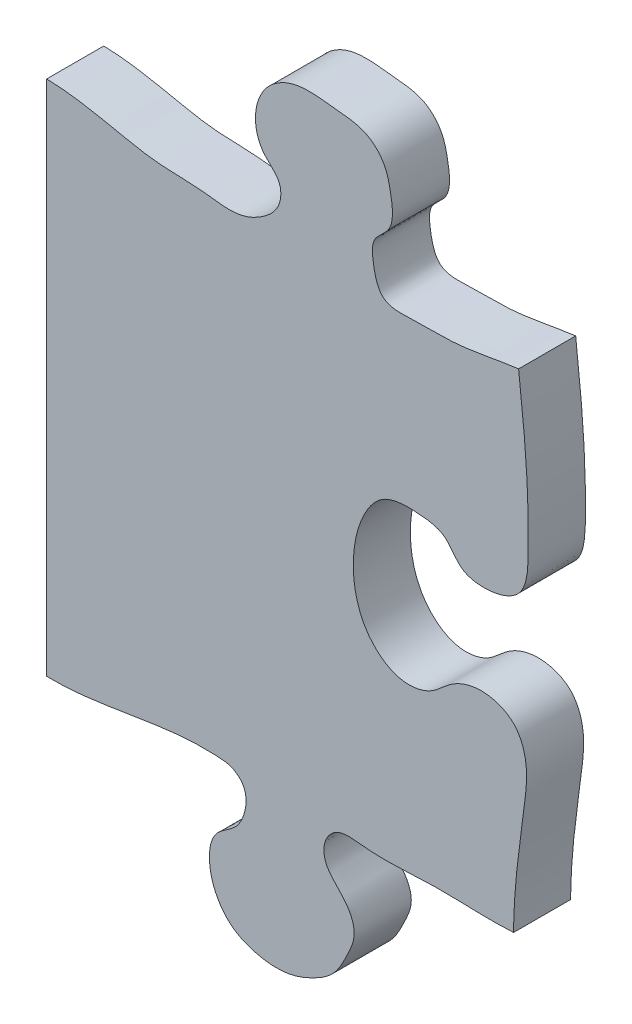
ISO-10303-21;
HEADER;
FILE_DESCRIPTION(('STEP AP214'),'2;1');
FILE_NAME('part.step','',(''),(''),'','','');
FILE_SCHEMA(('AUTOMOTIVE_DESIGN { 1 0 10303 214 1 1 1 1 }'));
ENDSEC;
DATA;
#1=APPLICATION_CONTEXT('core data for automotive mechanical design processes');
#2=APPLICATION_PROTOCOL_DEFINITION('international standard','automotive_design',2000,#1);
#3=PRODUCT_CONTEXT('',#1,'mechanical');
#4=PRODUCT('Part','Part','',(#3));
#5=PRODUCT_RELATED_PRODUCT_CATEGORY('part','',(#4));
#6=PRODUCT_DEFINITION_FORMATION('','',#4);
#7=PRODUCT_DEFINITION_CONTEXT('part definition',#1,'design');
#8=PRODUCT_DEFINITION('design','',#6,#7);
#9=PRODUCT_DEFINITION_SHAPE('','',#8);
#10=(LENGTH_UNIT() NAMED_UNIT(*) SI_UNIT(.MILLI.,.METRE.));
#11=(NAMED_UNIT(*) PLANE_ANGLE_UNIT() SI_UNIT($,.RADIAN.));
#12=(NAMED_UNIT(*) SI_UNIT($,.STERADIAN.) SOLID_ANGLE_UNIT());
#13=UNCERTAINTY_MEASURE_WITH_UNIT(LENGTH_MEASURE(1.E-05),#10,'distance_accuracy_value','');
#14=(GEOMETRIC_REPRESENTATION_CONTEXT(3) GLOBAL_UNCERTAINTY_ASSIGNED_CONTEXT((#13)) GLOBAL_UNIT_ASSIGNED_CONTEXT((#10,
#11,#12)) REPRESENTATION_CONTEXT('',''));
#15=CARTESIAN_POINT('',(0.,0.,0.));
#16=DIRECTION('',(0.,0.,1.));
#17=DIRECTION('',(1.,0.,0.));
#18=AXIS2_PLACEMENT_3D('',#15,#16,#17);
#19=CARTESIAN_POINT('',(-352.534626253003,356.,-0.00999999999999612));
#20=CARTESIAN_POINT('',(-353.877781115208,341.802611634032,-0.00999999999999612));
#21=CARTESIAN_POINT('',(-351.460483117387,322.567956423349,-0.00999999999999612));
#22=CARTESIAN_POINT('',(-355.747404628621,299.493999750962,-0.00999999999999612));
#23=CARTESIAN_POINT('',(-347.645743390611,289.357079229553,-0.00999999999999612));
#24=CARTESIAN_POINT('',(-337.80105524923,293.322704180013,-0.00999999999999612));
#25=CARTESIAN_POINT('',(-331.763521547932,304.464683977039,-0.00999999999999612));
#26=CARTESIAN_POINT('',(-312.737993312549,300.417040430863,-0.00999999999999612));
#27=CARTESIAN_POINT('',(-304.311514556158,284.867329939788,-0.00999999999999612));
#28=CARTESIAN_POINT('',(-301.362858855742,267.518539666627,-0.00999999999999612));
#29=CARTESIAN_POINT('',(-309.525260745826,253.299800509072,-0.00999999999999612));
#30=CARTESIAN_POINT('',(-323.085028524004,249.130779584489,-0.00999999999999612));
#31=CARTESIAN_POINT('',(-333.558735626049,254.453066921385,-0.00999999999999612));
#32=CARTESIAN_POINT('',(-338.061007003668,263.306234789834,-0.00999999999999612));
#33=CARTESIAN_POINT('',(-357.610347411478,266.663664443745,-0.00999999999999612));
#34=CARTESIAN_POINT('',(-352.91397083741,227.568949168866,-0.00999999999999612));
#35=CARTESIAN_POINT('',(-349.689076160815,203.209436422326,-0.00999999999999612));
#36=CARTESIAN_POINT('',(-346.386977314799,175.800103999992,-0.00999999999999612));
#37=CARTESIAN_POINT('',(-343.691373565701,150.269708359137,-0.00999999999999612));
#38=CARTESIAN_POINT('',(-342.931567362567,128.594211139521,-0.00999999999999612));
#39=CARTESIAN_POINT('',(-343.655360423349,107.633085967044,-0.00999999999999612));
#40=CARTESIAN_POINT('',(-357.389603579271,103.824438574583,-0.00999999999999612));
#41=CARTESIAN_POINT('',(-367.576419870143,106.015828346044,-0.00999999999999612));
#42=CARTESIAN_POINT('',(-371.765750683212,114.589953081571,-0.00999999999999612));
#43=CARTESIAN_POINT('',(-382.535012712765,116.182843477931,-0.00999999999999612));
#44=CARTESIAN_POINT('',(-394.783984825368,115.916744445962,-0.00999999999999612));
#45=CARTESIAN_POINT('',(-402.322369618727,104.396558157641,-0.00999999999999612));
#46=CARTESIAN_POINT('',(-405.688784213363,89.1486295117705,-0.00999999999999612));
#47=CARTESIAN_POINT('',(-402.964002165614,71.2455616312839,-0.00999999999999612));
#48=CARTESIAN_POINT('',(-389.022909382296,60.8761001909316,-0.00999999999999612));
#49=CARTESIAN_POINT('',(-377.013010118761,63.0649709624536,-0.00999999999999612));
#50=CARTESIAN_POINT('',(-370.136212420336,70.9200889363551,-0.00999999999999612));
#51=CARTESIAN_POINT('',(-359.248489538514,74.3793713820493,-0.00999999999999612));
#52=CARTESIAN_POINT('',(-347.964757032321,70.4189230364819,-0.00999999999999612));
#53=CARTESIAN_POINT('',(-342.961480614,58.8762689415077,-0.00999999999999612));
#54=CARTESIAN_POINT('',(-344.957853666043,42.6141567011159,-0.00999999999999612));
#55=CARTESIAN_POINT('',(-348.090347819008,20.9428011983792,-0.00999999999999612));
#56=CARTESIAN_POINT('',(-348.787112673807,-1.92187291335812,-0.00999999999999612));
#57=CARTESIAN_POINT('',(-347.063507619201,-23.1354473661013,-0.00999999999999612));
#58=CARTESIAN_POINT('',(-345.803834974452,-40.1989543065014,-0.00999999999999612));
#59=CARTESIAN_POINT('',(-346.365109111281,-52.5147126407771,-0.00999999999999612));
#60=CARTESIAN_POINT('',(-346.987719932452,-61.0081322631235,-0.00999999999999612));
#61=CARTESIAN_POINT('',(-354.605588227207,-67.8105997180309,-0.00999999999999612));
#62=CARTESIAN_POINT('',(-368.483652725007,-69.9483525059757,-0.00999999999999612));
#63=CARTESIAN_POINT('',(-374.929468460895,-56.6181815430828,-0.00999999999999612));
#64=CARTESIAN_POINT('',(-389.51528778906,-54.9578642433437,-0.00999999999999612));
#65=CARTESIAN_POINT('',(-403.927113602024,-62.7741481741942,-0.00999999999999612));
#66=CARTESIAN_POINT('',(-408.906740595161,-79.6272624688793,-0.00999999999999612));
#67=CARTESIAN_POINT('',(-407.354009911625,-95.181625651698,-0.00999999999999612));
#68=CARTESIAN_POINT('',(-399.108136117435,-108.127376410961,-0.00999999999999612));
#69=CARTESIAN_POINT('',(-382.721304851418,-112.332091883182,-0.00999999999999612));
#70=CARTESIAN_POINT('',(-372.627066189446,-99.6029758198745,-0.00999999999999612));
#71=CARTESIAN_POINT('',(-359.245942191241,-98.6507630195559,-0.00999999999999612));
#72=CARTESIAN_POINT('',(-346.811479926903,-105.357996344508,-0.00999999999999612));
#73=CARTESIAN_POINT('',(-347.06309899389,-122.824759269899,-0.00999999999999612));
#74=CARTESIAN_POINT('',(-349.512128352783,-142.867981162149,-0.00999999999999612));
#75=CARTESIAN_POINT('',(-351.967561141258,-164.813498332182,-0.00999999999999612));
#76=CARTESIAN_POINT('',(-354.173348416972,-189.531702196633,-0.00999999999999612));
#77=CARTESIAN_POINT('',(-353.048503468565,-212.668893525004,-0.00999999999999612));
#78=CARTESIAN_POINT('',(-354.739062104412,-232.840407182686,-0.00999999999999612));
#79=CARTESIAN_POINT('',(-344.245211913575,-244.921596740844,-0.00999999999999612));
#80=CARTESIAN_POINT('',(-336.376475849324,-237.735778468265,-0.00999999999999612));
#81=CARTESIAN_POINT('',(-333.938993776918,-228.321764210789,-0.00999999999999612));
#82=CARTESIAN_POINT('',(-321.423877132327,-226.689197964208,-0.00999999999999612));
#83=CARTESIAN_POINT('',(-310.83224361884,-232.911014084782,-0.00999999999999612));
#84=CARTESIAN_POINT('',(-302.540379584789,-246.611975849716,-0.00999999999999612));
#85=CARTESIAN_POINT('',(-304.049270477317,-262.348985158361,-0.00999999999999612));
#86=CARTESIAN_POINT('',(-307.19247660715,-276.895908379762,-0.00999999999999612));
#87=CARTESIAN_POINT('',(-317.916754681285,-281.774853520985,-0.00999999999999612));
#88=CARTESIAN_POINT('',(-328.48323529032,-282.130896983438,-0.00999999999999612));
#89=CARTESIAN_POINT('',(-335.177873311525,-274.391757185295,-0.00999999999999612));
#90=CARTESIAN_POINT('',(-340.967044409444,-267.020526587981,-0.00999999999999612));
#91=CARTESIAN_POINT('',(-352.493784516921,-268.657509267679,-0.00999999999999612));
#92=CARTESIAN_POINT('',(-357.686319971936,-282.822093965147,-0.00999999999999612));
#93=CARTESIAN_POINT('',(-357.597756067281,-311.53856504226,-0.00999999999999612));
#94=CARTESIAN_POINT('',(-355.656952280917,-337.76537977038,-0.00999999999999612));
#95=CARTESIAN_POINT('',(-354.035135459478,-356.,-0.00999999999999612));
#96=B_SPLINE_CURVE_WITH_KNOTS('',3,(#19,#20,#21,#22,#23,#24,#25,#26,#27,#28,#29,#30,#31,#32,#33,
#34,#35,#36,#37,#38,#39,#40,#41,#42,#43,#44,#45,#46,#47,#48,#49,#50,#51,#52,#53,#54,#55,#56,#57,
#58,#59,#60,#61,#62,#63,#64,#65,#66,#67,#68,#69,#70,#71,#72,#73,#74,#75,#76,#77,#78,#79,#80,#81,
#82,#83,#84,#85,#86,#87,#88,#89,#90,#91,#92,#93,#94,#95),.UNSPECIFIED.,.F.,.F.,(4,1,1,1,1,1,1,1,
1,1,1,1,1,1,1,1,1,1,1,1,1,1,1,1,1,1,1,1,1,1,1,1,1,1,1,1,1,1,1,1,1,1,1,1,1,1,1,1,1,1,1,1,1,1,1,1,
1,1,1,1,1,1,1,1,1,1,1,1,1,1,1,1,1,1,4),(0.,0.0362663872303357,0.0516957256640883,
0.0575126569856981,0.0656061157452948,0.0738542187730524,0.0886191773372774,0.103761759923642,
0.118344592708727,0.132658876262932,0.141706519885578,0.152628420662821,0.159936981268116,
0.166346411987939,0.196099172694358,0.222591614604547,0.242329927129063,0.265519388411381,
0.28892287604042,0.3014399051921,0.313339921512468,0.3200215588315,0.327007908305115,
0.335496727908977,0.346341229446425,0.356695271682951,0.367736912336,0.387395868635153,
0.399447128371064,0.408443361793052,0.416078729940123,0.425886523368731,0.4364139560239,
0.44355209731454,0.456701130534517,0.478081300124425,0.500737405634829,0.515722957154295,
0.53328305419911,0.545176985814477,0.547408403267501,0.555597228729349,0.568417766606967,
0.576959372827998,0.589646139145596,0.601337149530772,0.617107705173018,0.631663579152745,
0.64088779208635,0.655943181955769,0.666193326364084,0.679689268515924,0.687162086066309,
0.700019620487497,0.719317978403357,0.742088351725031,0.756487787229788,0.783860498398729,
0.801622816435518,0.8097052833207,0.815461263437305,0.824516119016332,0.833497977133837,
0.842909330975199,0.85562007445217,0.872330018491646,0.883598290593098,0.890881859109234,
0.901363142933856,0.908021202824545,0.916645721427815,0.924017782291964,0.933106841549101,
0.95201687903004,1.),.UNSPECIFIED.);
#97=DIRECTION('',(0.,0.,1.));
#98=VECTOR('',#97,1.);
#99=SURFACE_OF_LINEAR_EXTRUSION('',#96,#98);
#100=CARTESIAN_POINT('',(-352.534626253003,356.,20.));
#101=CARTESIAN_POINT('',(-353.877781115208,341.802611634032,20.));
#102=CARTESIAN_POINT('',(-351.460483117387,322.567956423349,20.));
#103=CARTESIAN_POINT('',(-355.747404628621,299.493999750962,20.));
#104=CARTESIAN_POINT('',(-347.645743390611,289.357079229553,20.));
#105=CARTESIAN_POINT('',(-337.80105524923,293.322704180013,20.));
#106=CARTESIAN_POINT('',(-331.763521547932,304.464683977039,20.));
#107=CARTESIAN_POINT('',(-312.737993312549,300.417040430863,20.));
#108=CARTESIAN_POINT('',(-304.311514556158,284.867329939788,20.));
#109=CARTESIAN_POINT('',(-301.362858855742,267.518539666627,20.));
#110=CARTESIAN_POINT('',(-309.525260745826,253.299800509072,20.));
#111=CARTESIAN_POINT('',(-323.085028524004,249.130779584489,20.));
#112=CARTESIAN_POINT('',(-333.558735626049,254.453066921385,20.));
#113=CARTESIAN_POINT('',(-338.061007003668,263.306234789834,20.));
#114=CARTESIAN_POINT('',(-357.610347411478,266.663664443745,20.));
#115=CARTESIAN_POINT('',(-352.91397083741,227.568949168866,20.));
#116=CARTESIAN_POINT('',(-349.689076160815,203.209436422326,20.));
#117=CARTESIAN_POINT('',(-346.386977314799,175.800103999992,20.));
#118=CARTESIAN_POINT('',(-343.691373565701,150.269708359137,20.));
#119=CARTESIAN_POINT('',(-342.931567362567,128.594211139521,20.));
#120=CARTESIAN_POINT('',(-343.655360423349,107.633085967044,20.));
#121=CARTESIAN_POINT('',(-357.389603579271,103.824438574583,20.));
#122=CARTESIAN_POINT('',(-367.576419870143,106.015828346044,20.));
#123=CARTESIAN_POINT('',(-371.765750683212,114.589953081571,20.));
#124=CARTESIAN_POINT('',(-382.535012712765,116.182843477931,20.));
#125=CARTESIAN_POINT('',(-394.783984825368,115.916744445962,20.));
#126=CARTESIAN_POINT('',(-402.322369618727,104.396558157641,20.));
#127=CARTESIAN_POINT('',(-405.688784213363,89.1486295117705,20.));
#128=CARTESIAN_POINT('',(-402.964002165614,71.2455616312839,20.));
#129=CARTESIAN_POINT('',(-389.022909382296,60.8761001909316,20.));
#130=CARTESIAN_POINT('',(-377.013010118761,63.0649709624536,20.));
#131=CARTESIAN_POINT('',(-370.136212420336,70.9200889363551,20.));
#132=CARTESIAN_POINT('',(-359.248489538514,74.3793713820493,20.));
#133=CARTESIAN_POINT('',(-347.964757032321,70.4189230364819,20.));
#134=CARTESIAN_POINT('',(-342.961480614,58.8762689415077,20.));
#135=CARTESIAN_POINT('',(-344.957853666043,42.6141567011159,20.));
#136=CARTESIAN_POINT('',(-348.090347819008,20.9428011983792,20.));
#137=CARTESIAN_POINT('',(-348.787112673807,-1.92187291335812,20.));
#138=CARTESIAN_POINT('',(-347.063507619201,-23.1354473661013,20.));
#139=CARTESIAN_POINT('',(-345.803834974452,-40.1989543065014,20.));
#140=CARTESIAN_POINT('',(-346.365109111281,-52.5147126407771,20.));
#141=CARTESIAN_POINT('',(-346.987719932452,-61.0081322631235,20.));
#142=CARTESIAN_POINT('',(-354.605588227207,-67.8105997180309,20.));
#143=CARTESIAN_POINT('',(-368.483652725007,-69.9483525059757,20.));
#144=CARTESIAN_POINT('',(-374.929468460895,-56.6181815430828,20.));
#145=CARTESIAN_POINT('',(-389.51528778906,-54.9578642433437,20.));
#146=CARTESIAN_POINT('',(-403.927113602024,-62.7741481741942,20.));
#147=CARTESIAN_POINT('',(-408.906740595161,-79.6272624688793,20.));
#148=CARTESIAN_POINT('',(-407.354009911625,-95.181625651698,20.));
#149=CARTESIAN_POINT('',(-399.108136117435,-108.127376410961,20.));
#150=CARTESIAN_POINT('',(-382.721304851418,-112.332091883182,20.));
#151=CARTESIAN_POINT('',(-372.627066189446,-99.6029758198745,20.));
#152=CARTESIAN_POINT('',(-359.245942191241,-98.6507630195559,20.));
#153=CARTESIAN_POINT('',(-346.811479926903,-105.357996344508,20.));
#154=CARTESIAN_POINT('',(-347.06309899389,-122.824759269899,20.));
#155=CARTESIAN_POINT('',(-349.512128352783,-142.867981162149,20.));
#156=CARTESIAN_POINT('',(-351.967561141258,-164.813498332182,20.));
#157=CARTESIAN_POINT('',(-354.173348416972,-189.531702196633,20.));
#158=CARTESIAN_POINT('',(-353.048503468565,-212.668893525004,20.));
#159=CARTESIAN_POINT('',(-354.739062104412,-232.840407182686,20.));
#160=CARTESIAN_POINT('',(-344.245211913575,-244.921596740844,20.));
#161=CARTESIAN_POINT('',(-336.376475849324,-237.735778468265,20.));
#162=CARTESIAN_POINT('',(-333.938993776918,-228.321764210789,20.));
#163=CARTESIAN_POINT('',(-321.423877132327,-226.689197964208,20.));
#164=CARTESIAN_POINT('',(-310.83224361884,-232.911014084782,20.));
#165=CARTESIAN_POINT('',(-302.540379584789,-246.611975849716,20.));
#166=CARTESIAN_POINT('',(-304.049270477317,-262.348985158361,20.));
#167=CARTESIAN_POINT('',(-307.19247660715,-276.895908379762,20.));
#168=CARTESIAN_POINT('',(-317.916754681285,-281.774853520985,20.));
#169=CARTESIAN_POINT('',(-328.48323529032,-282.130896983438,20.));
#170=CARTESIAN_POINT('',(-335.177873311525,-274.391757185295,20.));
#171=CARTESIAN_POINT('',(-340.967044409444,-267.020526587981,20.));
#172=CARTESIAN_POINT('',(-352.493784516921,-268.657509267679,20.));
#173=CARTESIAN_POINT('',(-357.686319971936,-282.822093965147,20.));
#174=CARTESIAN_POINT('',(-357.597756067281,-311.53856504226,20.));
#175=CARTESIAN_POINT('',(-355.656952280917,-337.76537977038,20.));
#176=CARTESIAN_POINT('',(-354.035135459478,-356.,20.));
#177=B_SPLINE_CURVE_WITH_KNOTS('',3,(#100,#101,#102,#103,#104,#105,#106,#107,#108,#109,#110,
#111,#112,#113,#114,#115,#116,#117,#118,#119,#120,#121,#122,#123,#124,#125,#126,#127,#128,#129,
#130,#131,#132,#133,#134,#135,#136,#137,#138,#139,#140,#141,#142,#143,#144,#145,#146,#147,#148,
#149,#150,#151,#152,#153,#154,#155,#156,#157,#158,#159,#160,#161,#162,#163,#164,#165,#166,#167,
#168,#169,#170,#171,#172,#173,#174,#175,#176),.UNSPECIFIED.,.F.,.F.,(4,1,1,1,1,1,1,1,1,1,1,1,1,
1,1,1,1,1,1,1,1,1,1,1,1,1,1,1,1,1,1,1,1,1,1,1,1,1,1,1,1,1,1,1,1,1,1,1,1,1,1,1,1,1,1,1,1,1,1,1,1,
1,1,1,1,1,1,1,1,1,1,1,1,1,4),(0.,0.0362663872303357,0.0516957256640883,0.0575126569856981,
0.0656061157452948,0.0738542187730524,0.0886191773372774,0.103761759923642,0.118344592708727,
0.132658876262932,0.141706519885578,0.152628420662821,0.159936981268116,0.166346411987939,
0.196099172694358,0.222591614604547,0.242329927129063,0.265519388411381,0.28892287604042,
0.3014399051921,0.313339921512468,0.3200215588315,0.327007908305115,0.335496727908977,
0.346341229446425,0.356695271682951,0.367736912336,0.387395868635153,0.399447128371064,
0.408443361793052,0.416078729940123,0.425886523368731,0.4364139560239,0.44355209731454,
0.456701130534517,0.478081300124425,0.500737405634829,0.515722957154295,0.53328305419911,
0.545176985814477,0.547408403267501,0.555597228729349,0.568417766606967,0.576959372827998,
0.589646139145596,0.601337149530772,0.617107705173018,0.631663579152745,0.64088779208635,
0.655943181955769,0.666193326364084,0.679689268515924,0.687162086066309,0.700019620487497,
0.719317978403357,0.742088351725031,0.756487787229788,0.783860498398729,0.801622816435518,
0.8097052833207,0.815461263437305,0.824516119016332,0.833497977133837,0.842909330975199,
0.85562007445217,0.872330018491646,0.883598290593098,0.890881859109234,0.901363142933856,
0.908021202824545,0.916645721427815,0.924017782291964,0.933106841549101,0.95201687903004,1.),.UNSPECIFIED.);
#178=CARTESIAN_POINT('',(-346.614016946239,177.25293926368,20.));
#179=VERTEX_POINT('',#178);
#180=CARTESIAN_POINT('',(-348.40314200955,5.28695656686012,20.));
#181=VERTEX_POINT('',#180);
#182=EDGE_CURVE('E43',#179,#181,#177,.T.);
#183=ORIENTED_EDGE('',*,*,#182,.T.);
#184=DIRECTION('',(0.,0.,1.));
#185=VECTOR('',#184,1.);
#186=CARTESIAN_POINT('',(-348.403142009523,5.28695656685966,-0.00999999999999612));
#187=LINE('',#186,#185);
#188=CARTESIAN_POINT('',(-348.40314200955,5.28695656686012,0.));
#189=VERTEX_POINT('',#188);
#190=EDGE_CURVE('E38',#181,#189,#187,.F.);
#191=ORIENTED_EDGE('',*,*,#190,.T.);
#192=CARTESIAN_POINT('',(-352.534626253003,356.,0.));
#193=CARTESIAN_POINT('',(-353.877781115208,341.802611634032,0.));
#194=CARTESIAN_POINT('',(-351.460483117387,322.567956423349,0.));
#195=CARTESIAN_POINT('',(-355.747404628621,299.493999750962,0.));
#196=CARTESIAN_POINT('',(-347.645743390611,289.357079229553,0.));
#197=CARTESIAN_POINT('',(-337.80105524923,293.322704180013,0.));
#198=CARTESIAN_POINT('',(-331.763521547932,304.464683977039,0.));
#199=CARTESIAN_POINT('',(-312.737993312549,300.417040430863,0.));
#200=CARTESIAN_POINT('',(-304.311514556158,284.867329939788,0.));
#201=CARTESIAN_POINT('',(-301.362858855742,267.518539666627,0.));
#202=CARTESIAN_POINT('',(-309.525260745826,253.299800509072,0.));
#203=CARTESIAN_POINT('',(-323.085028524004,249.130779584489,0.));
#204=CARTESIAN_POINT('',(-333.558735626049,254.453066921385,0.));
#205=CARTESIAN_POINT('',(-338.061007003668,263.306234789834,0.));
#206=CARTESIAN_POINT('',(-357.610347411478,266.663664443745,0.));
#207=CARTESIAN_POINT('',(-352.91397083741,227.568949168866,0.));
#208=CARTESIAN_POINT('',(-349.689076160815,203.209436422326,0.));
#209=CARTESIAN_POINT('',(-346.386977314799,175.800103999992,0.));
#210=CARTESIAN_POINT('',(-343.691373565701,150.269708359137,0.));
#211=CARTESIAN_POINT('',(-342.931567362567,128.594211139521,0.));
#212=CARTESIAN_POINT('',(-343.655360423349,107.633085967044,0.));
#213=CARTESIAN_POINT('',(-357.389603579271,103.824438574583,0.));
#214=CARTESIAN_POINT('',(-367.576419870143,106.015828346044,0.));
#215=CARTESIAN_POINT('',(-371.765750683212,114.589953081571,0.));
#216=CARTESIAN_POINT('',(-382.535012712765,116.182843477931,0.));
#217=CARTESIAN_POINT('',(-394.783984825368,115.916744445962,0.));
#218=CARTESIAN_POINT('',(-402.322369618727,104.396558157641,0.));
#219=CARTESIAN_POINT('',(-405.688784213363,89.1486295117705,0.));
#220=CARTESIAN_POINT('',(-402.964002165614,71.2455616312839,0.));
#221=CARTESIAN_POINT('',(-389.022909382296,60.8761001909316,0.));
#222=CARTESIAN_POINT('',(-377.013010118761,63.0649709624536,0.));
#223=CARTESIAN_POINT('',(-370.136212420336,70.9200889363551,0.));
#224=CARTESIAN_POINT('',(-359.248489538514,74.3793713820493,0.));
#225=CARTESIAN_POINT('',(-347.964757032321,70.4189230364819,0.));
#226=CARTESIAN_POINT('',(-342.961480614,58.8762689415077,0.));
#227=CARTESIAN_POINT('',(-344.957853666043,42.6141567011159,0.));
#228=CARTESIAN_POINT('',(-348.090347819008,20.9428011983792,0.));
#229=CARTESIAN_POINT('',(-348.787112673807,-1.92187291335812,0.));
#230=CARTESIAN_POINT('',(-347.063507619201,-23.1354473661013,0.));
#231=CARTESIAN_POINT('',(-345.803834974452,-40.1989543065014,0.));
#232=CARTESIAN_POINT('',(-346.365109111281,-52.5147126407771,0.));
#233=CARTESIAN_POINT('',(-346.987719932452,-61.0081322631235,0.));
#234=CARTESIAN_POINT('',(-354.605588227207,-67.8105997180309,0.));
#235=CARTESIAN_POINT('',(-368.483652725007,-69.9483525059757,0.));
#236=CARTESIAN_POINT('',(-374.929468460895,-56.6181815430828,0.));
#237=CARTESIAN_POINT('',(-389.51528778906,-54.9578642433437,0.));
#238=CARTESIAN_POINT('',(-403.927113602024,-62.7741481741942,0.));
#239=CARTESIAN_POINT('',(-408.906740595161,-79.6272624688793,0.));
#240=CARTESIAN_POINT('',(-407.354009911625,-95.181625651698,0.));
#241=CARTESIAN_POINT('',(-399.108136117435,-108.127376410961,0.));
#242=CARTESIAN_POINT('',(-382.721304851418,-112.332091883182,0.));
#243=CARTESIAN_POINT('',(-372.627066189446,-99.6029758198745,0.));
#244=CARTESIAN_POINT('',(-359.245942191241,-98.6507630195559,0.));
#245=CARTESIAN_POINT('',(-346.811479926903,-105.357996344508,0.));
#246=CARTESIAN_POINT('',(-347.06309899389,-122.824759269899,0.));
#247=CARTESIAN_POINT('',(-349.512128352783,-142.867981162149,0.));
#248=CARTESIAN_POINT('',(-351.967561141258,-164.813498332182,0.));
#249=CARTESIAN_POINT('',(-354.173348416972,-189.531702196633,0.));
#250=CARTESIAN_POINT('',(-353.048503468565,-212.668893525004,0.));
#251=CARTESIAN_POINT('',(-354.739062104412,-232.840407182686,0.));
#252=CARTESIAN_POINT('',(-344.245211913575,-244.921596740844,0.));
#253=CARTESIAN_POINT('',(-336.376475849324,-237.735778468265,0.));
#254=CARTESIAN_POINT('',(-333.938993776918,-228.321764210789,0.));
#255=CARTESIAN_POINT('',(-321.423877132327,-226.689197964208,0.));
#256=CARTESIAN_POINT('',(-310.83224361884,-232.911014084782,0.));
#257=CARTESIAN_POINT('',(-302.540379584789,-246.611975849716,0.));
#258=CARTESIAN_POINT('',(-304.049270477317,-262.348985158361,0.));
#259=CARTESIAN_POINT('',(-307.19247660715,-276.895908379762,0.));
#260=CARTESIAN_POINT('',(-317.916754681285,-281.774853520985,0.));
#261=CARTESIAN_POINT('',(-328.48323529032,-282.130896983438,0.));
#262=CARTESIAN_POINT('',(-335.177873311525,-274.391757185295,0.));
#263=CARTESIAN_POINT('',(-340.967044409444,-267.020526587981,0.));
#264=CARTESIAN_POINT('',(-352.493784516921,-268.657509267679,0.));
#265=CARTESIAN_POINT('',(-357.686319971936,-282.822093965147,0.));
#266=CARTESIAN_POINT('',(-357.597756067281,-311.53856504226,0.));
#267=CARTESIAN_POINT('',(-355.656952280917,-337.76537977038,0.));
#268=CARTESIAN_POINT('',(-354.035135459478,-356.,0.));
#269=B_SPLINE_CURVE_WITH_KNOTS('',3,(#192,#193,#194,#195,#196,#197,#198,#199,#200,#201,#202,
#203,#204,#205,#206,#207,#208,#209,#210,#211,#212,#213,#214,#215,#216,#217,#218,#219,#220,#221,
#222,#223,#224,#225,#226,#227,#228,#229,#230,#231,#232,#233,#234,#235,#236,#237,#238,#239,#240,
#241,#242,#243,#244,#245,#246,#247,#248,#249,#250,#251,#252,#253,#254,#255,#256,#257,#258,#259,
#260,#261,#262,#263,#264,#265,#266,#267,#268),.UNSPECIFIED.,.F.,.F.,(4,1,1,1,1,1,1,1,1,1,1,1,1,
1,1,1,1,1,1,1,1,1,1,1,1,1,1,1,1,1,1,1,1,1,1,1,1,1,1,1,1,1,1,1,1,1,1,1,1,1,1,1,1,1,1,1,1,1,1,1,1,
1,1,1,1,1,1,1,1,1,1,1,1,1,4),(0.,0.0362663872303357,0.0516957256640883,0.0575126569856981,
0.0656061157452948,0.0738542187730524,0.0886191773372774,0.103761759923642,0.118344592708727,
0.132658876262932,0.141706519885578,0.152628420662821,0.159936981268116,0.166346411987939,
0.196099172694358,0.222591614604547,0.242329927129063,0.265519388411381,0.28892287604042,
0.3014399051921,0.313339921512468,0.3200215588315,0.327007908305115,0.335496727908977,
0.346341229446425,0.356695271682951,0.367736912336,0.387395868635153,0.399447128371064,
0.408443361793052,0.416078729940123,0.425886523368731,0.4364139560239,0.44355209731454,
0.456701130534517,0.478081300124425,0.500737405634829,0.515722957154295,0.53328305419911,
0.545176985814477,0.547408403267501,0.555597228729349,0.568417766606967,0.576959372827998,
0.589646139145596,0.601337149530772,0.617107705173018,0.631663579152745,0.64088779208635,
0.655943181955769,0.666193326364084,0.679689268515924,0.687162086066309,0.700019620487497,
0.719317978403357,0.742088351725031,0.756487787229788,0.783860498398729,0.801622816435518,
0.8097052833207,0.815461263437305,0.824516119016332,0.833497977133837,0.842909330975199,
0.85562007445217,0.872330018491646,0.883598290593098,0.890881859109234,0.901363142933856,
0.908021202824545,0.916645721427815,0.924017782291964,0.933106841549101,0.95201687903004,1.),.UNSPECIFIED.);
#270=CARTESIAN_POINT('',(-346.614016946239,177.25293926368,0.));
#271=VERTEX_POINT('',#270);
#272=EDGE_CURVE('E186',#271,#189,#269,.T.);
#273=ORIENTED_EDGE('',*,*,#272,.F.);
#274=DIRECTION('',(0.,0.,1.));
#275=VECTOR('',#274,1.);
#276=CARTESIAN_POINT('',(-346.614016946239,177.25293926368,-0.00999999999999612));
#277=LINE('',#276,#275);
#278=EDGE_CURVE('E11',#271,#179,#277,.T.);
#279=ORIENTED_EDGE('',*,*,#278,.T.);
#280=EDGE_LOOP('',(#183,#191,#273,#279));
#281=FACE_BOUND('',#280,.T.);
#282=ADVANCED_FACE('F34',(#281),#99,.F.);
#283=CARTESIAN_POINT('',(-512.,182.54718893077,-0.00999999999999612));
#284=CARTESIAN_POINT('',(-502.994579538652,182.412705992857,-0.00999999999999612));
#285=CARTESIAN_POINT('',(-490.032252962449,179.483922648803,-0.00999999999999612));
#286=CARTESIAN_POINT('',(-471.955399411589,175.969991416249,-0.00999999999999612));
#287=CARTESIAN_POINT('',(-458.293816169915,176.407484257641,-0.00999999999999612));
#288=CARTESIAN_POINT('',(-445.56380036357,173.774845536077,-0.00999999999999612));
#289=CARTESIAN_POINT('',(-435.979338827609,178.264104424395,-0.00999999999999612));
#290=CARTESIAN_POINT('',(-429.893467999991,184.172588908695,-0.00999999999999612));
#291=CARTESIAN_POINT('',(-429.558480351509,192.942663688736,-0.00999999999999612));
#292=CARTESIAN_POINT('',(-436.734523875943,197.513062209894,-0.00999999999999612));
#293=CARTESIAN_POINT('',(-440.013304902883,207.37990412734,-0.00999999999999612));
#294=CARTESIAN_POINT('',(-436.620305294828,218.795290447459,-0.00999999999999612));
#295=CARTESIAN_POINT('',(-424.680250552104,225.919430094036,-0.00999999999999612));
#296=CARTESIAN_POINT('',(-411.901917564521,223.977194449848,-0.00999999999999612));
#297=CARTESIAN_POINT('',(-399.663909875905,223.173841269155,-0.00999999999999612));
#298=CARTESIAN_POINT('',(-393.048398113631,215.753844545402,-0.00999999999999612));
#299=CARTESIAN_POINT('',(-391.122239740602,207.108781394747,-0.00999999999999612));
#300=CARTESIAN_POINT('',(-389.789199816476,197.036802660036,-0.00999999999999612));
#301=CARTESIAN_POINT('',(-398.37475560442,191.784345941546,-0.00999999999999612));
#302=CARTESIAN_POINT('',(-397.652006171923,183.198912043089,-0.00999999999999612));
#303=CARTESIAN_POINT('',(-395.108426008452,172.857587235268,-0.00999999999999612));
#304=CARTESIAN_POINT('',(-381.593558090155,173.918582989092,-0.00999999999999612));
#305=CARTESIAN_POINT('',(-366.641883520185,173.326491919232,-0.00999999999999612));
#306=CARTESIAN_POINT('',(-353.981695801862,176.349283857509,-0.00999999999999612));
#307=CARTESIAN_POINT('',(-346.614016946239,177.25293926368,-0.00999999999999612));
#308=B_SPLINE_CURVE_WITH_KNOTS('',3,(#283,#284,#285,#286,#287,#288,#289,#290,#291,#292,#293,
#294,#295,#296,#297,#298,#299,#300,#301,#302,#303,#304,#305,#306,#307),.UNSPECIFIED.,.F.,.F.,(4,
1,1,1,1,1,1,1,1,1,1,1,1,1,1,1,1,1,1,1,1,1,4),(0.,0.104103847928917,0.153900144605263,
0.212653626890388,0.263123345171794,0.299098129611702,0.331105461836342,0.35735016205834,
0.387518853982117,0.421345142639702,0.47158565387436,0.512680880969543,0.570698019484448,
0.618413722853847,0.648743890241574,0.677248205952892,0.72332915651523,0.749747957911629,
0.779169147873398,0.816184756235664,0.856147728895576,0.912133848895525,1.),.UNSPECIFIED.);
#309=DIRECTION('',(0.,0.,1.));
#310=VECTOR('',#309,1.);
#311=SURFACE_OF_LINEAR_EXTRUSION('',#308,#310);
#312=DIRECTION('',(0.,0.,1.));
#313=VECTOR('',#312,1.);
#314=CARTESIAN_POINT('',(-512.,182.54718893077,-0.00999999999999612));
#315=LINE('',#314,#313);
#316=CARTESIAN_POINT('',(-512.,182.54718893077,20.));
#317=VERTEX_POINT('',#316);
#318=CARTESIAN_POINT('',(-512.,182.54718893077,0.));
#319=VERTEX_POINT('',#318);
#320=EDGE_CURVE('E88',#317,#319,#315,.F.);
#321=ORIENTED_EDGE('',*,*,#320,.F.);
#322=CARTESIAN_POINT('',(-512.,182.54718893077,20.));
#323=CARTESIAN_POINT('',(-502.994579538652,182.412705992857,20.));
#324=CARTESIAN_POINT('',(-490.032252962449,179.483922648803,20.));
#325=CARTESIAN_POINT('',(-471.955399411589,175.969991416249,20.));
#326=CARTESIAN_POINT('',(-458.293816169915,176.407484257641,20.));
#327=CARTESIAN_POINT('',(-445.56380036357,173.774845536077,20.));
#328=CARTESIAN_POINT('',(-435.979338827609,178.264104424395,20.));
#329=CARTESIAN_POINT('',(-429.893467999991,184.172588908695,20.));
#330=CARTESIAN_POINT('',(-429.558480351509,192.942663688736,20.));
#331=CARTESIAN_POINT('',(-436.734523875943,197.513062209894,20.));
#332=CARTESIAN_POINT('',(-440.013304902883,207.37990412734,20.));
#333=CARTESIAN_POINT('',(-436.620305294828,218.795290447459,20.));
#334=CARTESIAN_POINT('',(-424.680250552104,225.919430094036,20.));
#335=CARTESIAN_POINT('',(-411.901917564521,223.977194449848,20.));
#336=CARTESIAN_POINT('',(-399.663909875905,223.173841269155,20.));
#337=CARTESIAN_POINT('',(-393.048398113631,215.753844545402,20.));
#338=CARTESIAN_POINT('',(-391.122239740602,207.108781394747,20.));
#339=CARTESIAN_POINT('',(-389.789199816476,197.036802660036,20.));
#340=CARTESIAN_POINT('',(-398.37475560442,191.784345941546,20.));
#341=CARTESIAN_POINT('',(-397.652006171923,183.198912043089,20.));
#342=CARTESIAN_POINT('',(-395.108426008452,172.857587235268,20.));
#343=CARTESIAN_POINT('',(-381.593558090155,173.918582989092,20.));
#344=CARTESIAN_POINT('',(-366.641883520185,173.326491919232,20.));
#345=CARTESIAN_POINT('',(-353.981695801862,176.349283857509,20.));
#346=CARTESIAN_POINT('',(-346.614016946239,177.25293926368,20.));
#347=B_SPLINE_CURVE_WITH_KNOTS('',3,(#322,#323,#324,#325,#326,#327,#328,#329,#330,#331,#332,
#333,#334,#335,#336,#337,#338,#339,#340,#341,#342,#343,#344,#345,#346),.UNSPECIFIED.,.F.,.F.,(4,
1,1,1,1,1,1,1,1,1,1,1,1,1,1,1,1,1,1,1,1,1,4),(0.,0.104103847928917,0.153900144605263,
0.212653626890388,0.263123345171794,0.299098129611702,0.331105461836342,0.35735016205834,
0.387518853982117,0.421345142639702,0.47158565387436,0.512680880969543,0.570698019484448,
0.618413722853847,0.648743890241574,0.677248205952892,0.72332915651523,0.749747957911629,
0.779169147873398,0.816184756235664,0.856147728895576,0.912133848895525,1.),.UNSPECIFIED.);
#348=EDGE_CURVE('E101',#317,#179,#347,.T.);
#349=ORIENTED_EDGE('',*,*,#348,.T.);
#350=ORIENTED_EDGE('',*,*,#278,.F.);
#351=CARTESIAN_POINT('',(-512.,182.54718893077,0.));
#352=CARTESIAN_POINT('',(-502.994579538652,182.412705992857,0.));
#353=CARTESIAN_POINT('',(-490.032252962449,179.483922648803,0.));
#354=CARTESIAN_POINT('',(-471.955399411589,175.969991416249,0.));
#355=CARTESIAN_POINT('',(-458.293816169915,176.407484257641,0.));
#356=CARTESIAN_POINT('',(-445.56380036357,173.774845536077,0.));
#357=CARTESIAN_POINT('',(-435.979338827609,178.264104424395,0.));
#358=CARTESIAN_POINT('',(-429.893467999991,184.172588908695,0.));
#359=CARTESIAN_POINT('',(-429.558480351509,192.942663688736,0.));
#360=CARTESIAN_POINT('',(-436.734523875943,197.513062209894,0.));
#361=CARTESIAN_POINT('',(-440.013304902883,207.37990412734,0.));
#362=CARTESIAN_POINT('',(-436.620305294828,218.795290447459,0.));
#363=CARTESIAN_POINT('',(-424.680250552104,225.919430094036,0.));
#364=CARTESIAN_POINT('',(-411.901917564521,223.977194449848,0.));
#365=CARTESIAN_POINT('',(-399.663909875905,223.173841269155,0.));
#366=CARTESIAN_POINT('',(-393.048398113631,215.753844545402,0.));
#367=CARTESIAN_POINT('',(-391.122239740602,207.108781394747,0.));
#368=CARTESIAN_POINT('',(-389.789199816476,197.036802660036,0.));
#369=CARTESIAN_POINT('',(-398.37475560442,191.784345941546,0.));
#370=CARTESIAN_POINT('',(-397.652006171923,183.198912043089,0.));
#371=CARTESIAN_POINT('',(-395.108426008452,172.857587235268,0.));
#372=CARTESIAN_POINT('',(-381.593558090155,173.918582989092,0.));
#373=CARTESIAN_POINT('',(-366.641883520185,173.326491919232,0.));
#374=CARTESIAN_POINT('',(-353.981695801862,176.349283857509,0.));
#375=CARTESIAN_POINT('',(-346.614016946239,177.25293926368,0.));
#376=B_SPLINE_CURVE_WITH_KNOTS('',3,(#351,#352,#353,#354,#355,#356,#357,#358,#359,#360,#361,
#362,#363,#364,#365,#366,#367,#368,#369,#370,#371,#372,#373,#374,#375),.UNSPECIFIED.,.F.,.F.,(4,
1,1,1,1,1,1,1,1,1,1,1,1,1,1,1,1,1,1,1,1,1,4),(0.,0.104103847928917,0.153900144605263,
0.212653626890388,0.263123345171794,0.299098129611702,0.331105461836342,0.35735016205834,
0.387518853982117,0.421345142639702,0.47158565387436,0.512680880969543,0.570698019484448,
0.618413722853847,0.648743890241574,0.677248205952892,0.72332915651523,0.749747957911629,
0.779169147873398,0.816184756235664,0.856147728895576,0.912133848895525,1.),.UNSPECIFIED.);
#377=EDGE_CURVE('E160',#319,#271,#376,.T.);
#378=ORIENTED_EDGE('',*,*,#377,.F.);
#379=EDGE_LOOP('',(#321,#349,#350,#378));
#380=FACE_BOUND('',#379,.T.);
#381=ADVANCED_FACE('F138',(#380),#311,.F.);
#382=CARTESIAN_POINT('',(-349.139880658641,5.30046994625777,-0.00999999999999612));
#383=CARTESIAN_POINT('',(-339.887860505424,5.11479546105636,-0.00999999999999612));
#384=CARTESIAN_POINT('',(-319.891606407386,5.70075392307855,-0.00999999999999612));
#385=CARTESIAN_POINT('',(-312.057252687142,6.39377361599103,-0.00999999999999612));
#386=CARTESIAN_POINT('',(-295.557040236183,6.5821024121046,-0.00999999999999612));
#387=CARTESIAN_POINT('',(-287.520649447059,5.38238329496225,-0.00999999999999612));
#388=CARTESIAN_POINT('',(-282.231232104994,-0.739375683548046,-0.00999999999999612));
#389=CARTESIAN_POINT('',(-284.631758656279,-6.70157001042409,-0.00999999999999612));
#390=CARTESIAN_POINT('',(-290.291633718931,-11.4270553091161,-0.00999999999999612));
#391=CARTESIAN_POINT('',(-294.264404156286,-19.1154923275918,-0.00999999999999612));
#392=CARTESIAN_POINT('',(-294.324045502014,-31.0075730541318,-0.00999999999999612));
#393=CARTESIAN_POINT('',(-285.696757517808,-42.2618535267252,-0.00999999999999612));
#394=CARTESIAN_POINT('',(-271.389959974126,-47.4058055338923,-0.00999999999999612));
#395=CARTESIAN_POINT('',(-259.358947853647,-47.5927514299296,-0.00999999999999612));
#396=CARTESIAN_POINT('',(-248.949507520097,-41.269541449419,-0.00999999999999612));
#397=CARTESIAN_POINT('',(-243.879910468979,-32.2576865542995,-0.00999999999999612));
#398=CARTESIAN_POINT('',(-242.928014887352,-21.7896256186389,-0.00999999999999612));
#399=CARTESIAN_POINT('',(-249.227477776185,-14.851631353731,-0.00999999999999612));
#400=CARTESIAN_POINT('',(-254.593465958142,-9.43942563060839,-0.00999999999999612));
#401=CARTESIAN_POINT('',(-258.137345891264,-1.50662300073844,-0.00999999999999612));
#402=CARTESIAN_POINT('',(-253.898534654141,5.55474508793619,-0.00999999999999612));
#403=CARTESIAN_POINT('',(-243.567188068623,7.43755302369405,-0.00999999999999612));
#404=CARTESIAN_POINT('',(-237.879490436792,6.8669695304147,-0.00999999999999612));
#405=CARTESIAN_POINT('',(-212.535663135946,4.31355413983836,-0.00999999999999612));
#406=CARTESIAN_POINT('',(-204.857637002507,3.06770049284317,-0.00999999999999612));
#407=CARTESIAN_POINT('',(-187.870824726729,0.576823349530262,-0.00999999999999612));
#408=CARTESIAN_POINT('',(-180.873341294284,-0.585089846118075,-0.00999999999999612));
#409=CARTESIAN_POINT('',(-167.321297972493,-4.05861827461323,-0.00999999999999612));
#410=CARTESIAN_POINT('',(-158.264072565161,-5.81322262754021,-0.00999999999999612));
#411=CARTESIAN_POINT('',(-139.329328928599,-8.34288673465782,-0.00999999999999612));
#412=CARTESIAN_POINT('',(-132.040798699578,-2.9845391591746,-0.00999999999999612));
#413=CARTESIAN_POINT('',(-129.761885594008,4.23046807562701,-0.00999999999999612));
#414=CARTESIAN_POINT('',(-131.710784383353,10.4013258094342,-0.00999999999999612));
#415=CARTESIAN_POINT('',(-133.710968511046,14.6601816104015,-0.00999999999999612));
#416=CARTESIAN_POINT('',(-138.026269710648,21.724753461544,-0.00999999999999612));
#417=CARTESIAN_POINT('',(-138.081917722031,32.3728530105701,-0.00999999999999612));
#418=CARTESIAN_POINT('',(-131.83570692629,43.0815337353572,-0.00999999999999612));
#419=CARTESIAN_POINT('',(-119.794248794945,47.304204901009,-0.00999999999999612));
#420=CARTESIAN_POINT('',(-108.957899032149,47.5382470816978,-0.00999999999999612));
#421=CARTESIAN_POINT('',(-96.8719484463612,45.7015776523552,-0.00999999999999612));
#422=CARTESIAN_POINT('',(-87.0853124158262,37.0457421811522,-0.00999999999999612));
#423=CARTESIAN_POINT('',(-87.3806461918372,25.6113797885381,-0.00999999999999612));
#424=CARTESIAN_POINT('',(-91.1138584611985,18.4470720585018,-0.00999999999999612));
#425=CARTESIAN_POINT('',(-96.1690771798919,13.9582424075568,-0.00999999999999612));
#426=CARTESIAN_POINT('',(-97.7539111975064,6.63580226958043,-0.00999999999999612));
#427=CARTESIAN_POINT('',(-93.1531213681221,0.225805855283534,-0.00999999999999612));
#428=CARTESIAN_POINT('',(-85.7868945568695,-4.22125029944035,-0.00999999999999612));
#429=CARTESIAN_POINT('',(-75.4922823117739,-4.72742713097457,-0.00999999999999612));
#430=CARTESIAN_POINT('',(-63.6021774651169,-3.739894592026,-0.00999999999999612));
#431=CARTESIAN_POINT('',(-47.1576847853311,-2.15281130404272,-0.00999999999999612));
#432=CARTESIAN_POINT('',(-35.4735305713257,-1.02782701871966,-0.00999999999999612));
#433=CARTESIAN_POINT('',(-9.55974097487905,5.44923466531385,-0.00999999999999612));
#434=CARTESIAN_POINT('',(5.33335319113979,5.64341864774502,-0.00999999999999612));
#435=CARTESIAN_POINT('',(26.8877087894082,6.61154693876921,-0.00999999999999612));
#436=CARTESIAN_POINT('',(40.3616385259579,6.66752296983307,-0.00999999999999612));
#437=CARTESIAN_POINT('',(55.4069140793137,6.55682515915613,-0.00999999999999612));
#438=CARTESIAN_POINT('',(60.9823316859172,-1.76204700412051,-0.00999999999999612));
#439=CARTESIAN_POINT('',(62.7286219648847,-10.7101888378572,-0.00999999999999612));
#440=CARTESIAN_POINT('',(58.0719160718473,-18.2162229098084,-0.00999999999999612));
#441=CARTESIAN_POINT('',(50.4934538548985,-22.6369036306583,-0.00999999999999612));
#442=CARTESIAN_POINT('',(49.5191525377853,-32.4601424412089,-0.00999999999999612));
#443=CARTESIAN_POINT('',(50.9102608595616,-43.3041677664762,-0.00999999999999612));
#444=CARTESIAN_POINT('',(60.9494806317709,-51.7611152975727,-0.00999999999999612));
#445=CARTESIAN_POINT('',(73.8438777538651,-54.9427485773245,-0.00999999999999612));
#446=CARTESIAN_POINT('',(86.4324503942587,-54.0451489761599,-0.00999999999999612));
#447=CARTESIAN_POINT('',(96.2763408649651,-49.8211627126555,-0.00999999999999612));
#448=CARTESIAN_POINT('',(101.788676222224,-42.6926438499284,-0.00999999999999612));
#449=CARTESIAN_POINT('',(103.785622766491,-33.9307441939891,-0.00999999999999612));
#450=CARTESIAN_POINT('',(101.793989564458,-26.0744158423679,-0.00999999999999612));
#451=CARTESIAN_POINT('',(95.2302198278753,-18.82812621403,-0.00999999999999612));
#452=CARTESIAN_POINT('',(89.6165079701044,-10.8535457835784,-0.00999999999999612));
#453=CARTESIAN_POINT('',(88.5833289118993,0.119561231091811,-0.00999999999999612));
#454=CARTESIAN_POINT('',(98.1406475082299,6.80161389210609,-0.00999999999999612));
#455=CARTESIAN_POINT('',(110.075702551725,4.83412068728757,-0.00999999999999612));
#456=CARTESIAN_POINT('',(121.713926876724,4.79342247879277,-0.00999999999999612));
#457=CARTESIAN_POINT('',(136.161134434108,3.20442078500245,-0.00999999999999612));
#458=CARTESIAN_POINT('',(149.301551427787,2.24618232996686,-0.00999999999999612));
#459=CARTESIAN_POINT('',(163.635697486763,1.11607382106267,-0.00999999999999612));
#460=CARTESIAN_POINT('',(175.743984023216,-0.930199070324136,-0.00999999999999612));
#461=CARTESIAN_POINT('',(193.50042565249,-4.03526402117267,-0.00999999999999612));
#462=CARTESIAN_POINT('',(199.307125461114,-4.82007249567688,-0.00999999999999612));
#463=CARTESIAN_POINT('',(223.191668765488,-7.20796265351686,-0.00999999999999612));
#464=CARTESIAN_POINT('',(234.005762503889,-7.89583073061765,-0.00999999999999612));
#465=CARTESIAN_POINT('',(243.165304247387,-4.21144732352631,-0.00999999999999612));
#466=CARTESIAN_POINT('',(242.728227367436,5.29385628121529,-0.00999999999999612));
#467=CARTESIAN_POINT('',(239.691190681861,13.3923508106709,-0.00999999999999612));
#468=CARTESIAN_POINT('',(230.992924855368,17.259551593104,-0.00999999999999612));
#469=CARTESIAN_POINT('',(228.562234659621,35.6530691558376,-0.00999999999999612));
#470=CARTESIAN_POINT('',(241.485133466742,51.1639498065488,-0.00999999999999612));
#471=CARTESIAN_POINT('',(261.294428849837,50.4989765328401,-0.00999999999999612));
#472=CARTESIAN_POINT('',(273.311157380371,41.2796485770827,-0.00999999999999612));
#473=CARTESIAN_POINT('',(278.244185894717,29.7939334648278,-0.00999999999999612));
#474=CARTESIAN_POINT('',(278.46311043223,19.1716807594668,-0.00999999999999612));
#475=CARTESIAN_POINT('',(273.41239647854,11.7823053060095,-0.00999999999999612));
#476=CARTESIAN_POINT('',(269.462797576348,8.07180362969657,-0.00999999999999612));
#477=CARTESIAN_POINT('',(268.275297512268,1.27447756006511,-0.00999999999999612));
#478=CARTESIAN_POINT('',(269.56536006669,-2.1294813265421,-0.00999999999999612));
#479=CARTESIAN_POINT('',(273.239630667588,-8.77034024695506,-0.00999999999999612));
#480=CARTESIAN_POINT('',(289.550418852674,-6.96961632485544,-0.00999999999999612));
#481=CARTESIAN_POINT('',(304.280714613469,-6.71047567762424,-0.00999999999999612));
#482=CARTESIAN_POINT('',(324.326281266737,-6.23084088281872,-0.00999999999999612));
#483=CARTESIAN_POINT('',(349.235083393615,-7.00547217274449,-0.00999999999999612));
#484=CARTESIAN_POINT('',(375.517421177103,-8.89168640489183,-0.00999999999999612));
#485=CARTESIAN_POINT('',(398.91687007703,-8.79198570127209,-0.00999999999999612));
#486=CARTESIAN_POINT('',(415.173568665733,-7.26147865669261,-0.00999999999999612));
#487=CARTESIAN_POINT('',(418.590464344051,2.48372200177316,-0.00999999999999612));
#488=CARTESIAN_POINT('',(414.376255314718,7.33198876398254,-0.00999999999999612));
#489=CARTESIAN_POINT('',(409.420059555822,12.1922927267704,-0.00999999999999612));
#490=CARTESIAN_POINT('',(403.982345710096,21.0196469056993,-0.00999999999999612));
#491=CARTESIAN_POINT('',(405.486454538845,34.4252863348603,-0.00999999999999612));
#492=CARTESIAN_POINT('',(417.292648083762,42.4744659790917,-0.00999999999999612));
#493=CARTESIAN_POINT('',(430.971964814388,44.2079105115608,-0.00999999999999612));
#494=CARTESIAN_POINT('',(444.367703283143,42.5130395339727,-0.00999999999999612));
#495=CARTESIAN_POINT('',(452.635026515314,34.8362400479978,-0.00999999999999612));
#496=CARTESIAN_POINT('',(459.310429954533,27.5027807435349,-0.00999999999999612));
#497=CARTESIAN_POINT('',(458.249050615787,18.2902890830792,-0.00999999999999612));
#498=CARTESIAN_POINT('',(455.302955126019,10.0877891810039,-0.00999999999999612));
#499=CARTESIAN_POINT('',(448.406360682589,8.30941704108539,-0.00999999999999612));
#500=CARTESIAN_POINT('',(446.811865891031,2.1759580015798,-0.00999999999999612));
#501=CARTESIAN_POINT('',(451.102211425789,-2.40101244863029,-0.00999999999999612));
#502=CARTESIAN_POINT('',(456.533203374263,-6.13416812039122,-0.00999999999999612));
#503=CARTESIAN_POINT('',(468.262453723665,-6.69921981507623,-0.00999999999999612));
#504=CARTESIAN_POINT('',(486.320062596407,-6.06999038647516,-0.00999999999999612));
#505=CARTESIAN_POINT('',(502.630044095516,-5.50396307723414,-0.00999999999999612));
#506=CARTESIAN_POINT('',(512.,-5.81701820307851,-0.00999999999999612));
#507=B_SPLINE_CURVE_WITH_KNOTS('',3,(#382,#383,#384,#385,#386,#387,#388,#389,#390,#391,#392,
#393,#394,#395,#396,#397,#398,#399,#400,#401,#402,#403,#404,#405,#406,#407,#408,#409,#410,#411,
#412,#413,#414,#415,#416,#417,#418,#419,#420,#421,#422,#423,#424,#425,#426,#427,#428,#429,#430,
#431,#432,#433,#434,#435,#436,#437,#438,#439,#440,#441,#442,#443,#444,#445,#446,#447,#448,#449,
#450,#451,#452,#453,#454,#455,#456,#457,#458,#459,#460,#461,#462,#463,#464,#465,#466,#467,#468,
#469,#470,#471,#472,#473,#474,#475,#476,#477,#478,#479,#480,#481,#482,#483,#484,#485,#486,#487,
#488,#489,#490,#491,#492,#493,#494,#495,#496,#497,#498,#499,#500,#501,#502,#503,#504,#505,#506),
.UNSPECIFIED.,.F.,.F.,(4,1,1,1,1,1,1,1,1,1,1,1,1,1,1,1,1,1,1,1,1,1,1,1,1,1,1,1,1,1,1,1,1,1,1,1,
1,1,1,1,1,1,1,1,1,1,1,1,1,1,1,1,1,1,1,1,1,1,1,1,1,1,1,1,1,1,1,1,1,1,1,1,1,1,1,1,1,1,1,1,1,1,1,1,
1,1,1,1,1,1,1,1,1,1,1,1,1,1,1,1,1,1,1,1,1,1,1,1,1,1,1,1,1,1,1,1,1,1,1,1,1,1,4),(0.,
0.0203999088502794,0.032525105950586,0.0394079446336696,0.0429925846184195,0.0462028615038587,
0.0506774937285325,0.05482191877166,0.0612964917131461,0.0675853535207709,0.078206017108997,
0.0877657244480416,0.0973648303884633,0.104223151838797,0.110287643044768,0.118436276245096,
0.123325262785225,0.128697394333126,0.134348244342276,0.139464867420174,0.143004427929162,
0.154029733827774,0.165686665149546,0.174632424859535,0.180824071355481,0.188209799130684,
0.201784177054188,0.211152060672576,0.219187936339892,0.223061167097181,0.227413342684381,
0.231609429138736,0.235336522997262,0.240285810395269,0.247100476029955,0.256480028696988,
0.263295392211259,0.272209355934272,0.278498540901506,0.288104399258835,0.295607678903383,
0.299979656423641,0.304345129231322,0.309246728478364,0.313548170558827,0.319553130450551,
0.326293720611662,0.334109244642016,0.344082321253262,0.358264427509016,0.371018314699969,
0.38399064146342,0.394173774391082,0.409867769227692,0.416213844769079,0.42234168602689,
0.428532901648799,0.433885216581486,0.439261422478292,0.445456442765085,0.452298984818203,
0.460789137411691,0.470177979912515,0.479006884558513,0.486257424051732,0.491194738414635,
0.497076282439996,0.50308023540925,0.509890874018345,0.515931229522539,0.523373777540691,
0.52915668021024,0.537122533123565,0.545469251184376,0.555096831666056,0.566261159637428,
0.572611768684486,0.584261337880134,0.592302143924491,0.605983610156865,0.612919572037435,
0.623596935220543,0.628810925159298,0.634556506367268,0.640074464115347,0.645822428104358,
0.653868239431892,0.669756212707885,0.681576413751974,0.690541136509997,0.699365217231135,
0.706297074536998,0.711452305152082,0.716102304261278,0.720612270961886,0.721498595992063,
0.724965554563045,0.740526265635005,0.750839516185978,0.768228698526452,0.782843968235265,
0.812887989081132,0.829663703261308,0.842004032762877,0.846827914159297,0.85066745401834,
0.856368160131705,0.863967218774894,0.874786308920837,0.884930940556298,0.895673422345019,
0.907978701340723,0.915432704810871,0.922621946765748,0.930503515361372,0.936383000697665,
0.942324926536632,0.945307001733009,0.949799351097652,0.956034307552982,0.960974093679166,
0.977389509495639,1.),.UNSPECIFIED.);
#508=DIRECTION('',(0.,0.,1.));
#509=VECTOR('',#508,1.);
#510=SURFACE_OF_LINEAR_EXTRUSION('',#507,#509);
#511=ORIENTED_EDGE('',*,*,#190,.F.);
#512=CARTESIAN_POINT('',(-349.139880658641,5.30046994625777,20.));
#513=CARTESIAN_POINT('',(-339.887860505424,5.11479546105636,20.));
#514=CARTESIAN_POINT('',(-319.891606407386,5.70075392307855,20.));
#515=CARTESIAN_POINT('',(-312.057252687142,6.39377361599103,20.));
#516=CARTESIAN_POINT('',(-295.557040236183,6.5821024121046,20.));
#517=CARTESIAN_POINT('',(-287.520649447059,5.38238329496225,20.));
#518=CARTESIAN_POINT('',(-282.231232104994,-0.739375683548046,20.));
#519=CARTESIAN_POINT('',(-284.631758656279,-6.70157001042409,20.));
#520=CARTESIAN_POINT('',(-290.291633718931,-11.4270553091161,20.));
#521=CARTESIAN_POINT('',(-294.264404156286,-19.1154923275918,20.));
#522=CARTESIAN_POINT('',(-294.324045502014,-31.0075730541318,20.));
#523=CARTESIAN_POINT('',(-285.696757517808,-42.2618535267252,20.));
#524=CARTESIAN_POINT('',(-271.389959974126,-47.4058055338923,20.));
#525=CARTESIAN_POINT('',(-259.358947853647,-47.5927514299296,20.));
#526=CARTESIAN_POINT('',(-248.949507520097,-41.269541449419,20.));
#527=CARTESIAN_POINT('',(-243.879910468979,-32.2576865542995,20.));
#528=CARTESIAN_POINT('',(-242.928014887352,-21.7896256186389,20.));
#529=CARTESIAN_POINT('',(-249.227477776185,-14.851631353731,20.));
#530=CARTESIAN_POINT('',(-254.593465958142,-9.43942563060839,20.));
#531=CARTESIAN_POINT('',(-258.137345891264,-1.50662300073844,20.));
#532=CARTESIAN_POINT('',(-253.898534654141,5.55474508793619,20.));
#533=CARTESIAN_POINT('',(-243.567188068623,7.43755302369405,20.));
#534=CARTESIAN_POINT('',(-237.879490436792,6.8669695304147,20.));
#535=CARTESIAN_POINT('',(-212.535663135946,4.31355413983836,20.));
#536=CARTESIAN_POINT('',(-204.857637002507,3.06770049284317,20.));
#537=CARTESIAN_POINT('',(-187.870824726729,0.576823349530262,20.));
#538=CARTESIAN_POINT('',(-180.873341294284,-0.585089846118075,20.));
#539=CARTESIAN_POINT('',(-167.321297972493,-4.05861827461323,20.));
#540=CARTESIAN_POINT('',(-158.264072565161,-5.81322262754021,20.));
#541=CARTESIAN_POINT('',(-139.329328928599,-8.34288673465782,20.));
#542=CARTESIAN_POINT('',(-132.040798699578,-2.9845391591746,20.));
#543=CARTESIAN_POINT('',(-129.761885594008,4.23046807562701,20.));
#544=CARTESIAN_POINT('',(-131.710784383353,10.4013258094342,20.));
#545=CARTESIAN_POINT('',(-133.710968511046,14.6601816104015,20.));
#546=CARTESIAN_POINT('',(-138.026269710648,21.724753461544,20.));
#547=CARTESIAN_POINT('',(-138.081917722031,32.3728530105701,20.));
#548=CARTESIAN_POINT('',(-131.83570692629,43.0815337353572,20.));
#549=CARTESIAN_POINT('',(-119.794248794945,47.304204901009,20.));
#550=CARTESIAN_POINT('',(-108.957899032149,47.5382470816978,20.));
#551=CARTESIAN_POINT('',(-96.8719484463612,45.7015776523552,20.));
#552=CARTESIAN_POINT('',(-87.0853124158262,37.0457421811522,20.));
#553=CARTESIAN_POINT('',(-87.3806461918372,25.6113797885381,20.));
#554=CARTESIAN_POINT('',(-91.1138584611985,18.4470720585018,20.));
#555=CARTESIAN_POINT('',(-96.1690771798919,13.9582424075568,20.));
#556=CARTESIAN_POINT('',(-97.7539111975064,6.63580226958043,20.));
#557=CARTESIAN_POINT('',(-93.1531213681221,0.225805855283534,20.));
#558=CARTESIAN_POINT('',(-85.7868945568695,-4.22125029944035,20.));
#559=CARTESIAN_POINT('',(-75.4922823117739,-4.72742713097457,20.));
#560=CARTESIAN_POINT('',(-63.6021774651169,-3.739894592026,20.));
#561=CARTESIAN_POINT('',(-47.1576847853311,-2.15281130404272,20.));
#562=CARTESIAN_POINT('',(-35.4735305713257,-1.02782701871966,20.));
#563=CARTESIAN_POINT('',(-9.55974097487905,5.44923466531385,20.));
#564=CARTESIAN_POINT('',(5.33335319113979,5.64341864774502,20.));
#565=CARTESIAN_POINT('',(26.8877087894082,6.61154693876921,20.));
#566=CARTESIAN_POINT('',(40.3616385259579,6.66752296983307,20.));
#567=CARTESIAN_POINT('',(55.4069140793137,6.55682515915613,20.));
#568=CARTESIAN_POINT('',(60.9823316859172,-1.76204700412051,20.));
#569=CARTESIAN_POINT('',(62.7286219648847,-10.7101888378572,20.));
#570=CARTESIAN_POINT('',(58.0719160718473,-18.2162229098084,20.));
#571=CARTESIAN_POINT('',(50.4934538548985,-22.6369036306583,20.));
#572=CARTESIAN_POINT('',(49.5191525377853,-32.4601424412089,20.));
#573=CARTESIAN_POINT('',(50.9102608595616,-43.3041677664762,20.));
#574=CARTESIAN_POINT('',(60.9494806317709,-51.7611152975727,20.));
#575=CARTESIAN_POINT('',(73.8438777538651,-54.9427485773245,20.));
#576=CARTESIAN_POINT('',(86.4324503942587,-54.0451489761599,20.));
#577=CARTESIAN_POINT('',(96.2763408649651,-49.8211627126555,20.));
#578=CARTESIAN_POINT('',(101.788676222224,-42.6926438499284,20.));
#579=CARTESIAN_POINT('',(103.785622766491,-33.9307441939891,20.));
#580=CARTESIAN_POINT('',(101.793989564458,-26.0744158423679,20.));
#581=CARTESIAN_POINT('',(95.2302198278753,-18.82812621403,20.));
#582=CARTESIAN_POINT('',(89.6165079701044,-10.8535457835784,20.));
#583=CARTESIAN_POINT('',(88.5833289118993,0.119561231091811,20.));
#584=CARTESIAN_POINT('',(98.1406475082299,6.80161389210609,20.));
#585=CARTESIAN_POINT('',(110.075702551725,4.83412068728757,20.));
#586=CARTESIAN_POINT('',(121.713926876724,4.79342247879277,20.));
#587=CARTESIAN_POINT('',(136.161134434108,3.20442078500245,20.));
#588=CARTESIAN_POINT('',(149.301551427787,2.24618232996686,20.));
#589=CARTESIAN_POINT('',(163.635697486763,1.11607382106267,20.));
#590=CARTESIAN_POINT('',(175.743984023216,-0.930199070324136,20.));
#591=CARTESIAN_POINT('',(193.50042565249,-4.03526402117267,20.));
#592=CARTESIAN_POINT('',(199.307125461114,-4.82007249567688,20.));
#593=CARTESIAN_POINT('',(223.191668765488,-7.20796265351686,20.));
#594=CARTESIAN_POINT('',(234.005762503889,-7.89583073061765,20.));
#595=CARTESIAN_POINT('',(243.165304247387,-4.21144732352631,20.));
#596=CARTESIAN_POINT('',(242.728227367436,5.29385628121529,20.));
#597=CARTESIAN_POINT('',(239.691190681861,13.3923508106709,20.));
#598=CARTESIAN_POINT('',(230.992924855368,17.259551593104,20.));
#599=CARTESIAN_POINT('',(228.562234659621,35.6530691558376,20.));
#600=CARTESIAN_POINT('',(241.485133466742,51.1639498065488,20.));
#601=CARTESIAN_POINT('',(261.294428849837,50.4989765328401,20.));
#602=CARTESIAN_POINT('',(273.311157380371,41.2796485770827,20.));
#603=CARTESIAN_POINT('',(278.244185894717,29.7939334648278,20.));
#604=CARTESIAN_POINT('',(278.46311043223,19.1716807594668,20.));
#605=CARTESIAN_POINT('',(273.41239647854,11.7823053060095,20.));
#606=CARTESIAN_POINT('',(269.462797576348,8.07180362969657,20.));
#607=CARTESIAN_POINT('',(268.275297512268,1.27447756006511,20.));
#608=CARTESIAN_POINT('',(269.56536006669,-2.1294813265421,20.));
#609=CARTESIAN_POINT('',(273.239630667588,-8.77034024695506,20.));
#610=CARTESIAN_POINT('',(289.550418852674,-6.96961632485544,20.));
#611=CARTESIAN_POINT('',(304.280714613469,-6.71047567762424,20.));
#612=CARTESIAN_POINT('',(324.326281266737,-6.23084088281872,20.));
#613=CARTESIAN_POINT('',(349.235083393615,-7.00547217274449,20.));
#614=CARTESIAN_POINT('',(375.517421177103,-8.89168640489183,20.));
#615=CARTESIAN_POINT('',(398.91687007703,-8.79198570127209,20.));
#616=CARTESIAN_POINT('',(415.173568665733,-7.26147865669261,20.));
#617=CARTESIAN_POINT('',(418.590464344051,2.48372200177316,20.));
#618=CARTESIAN_POINT('',(414.376255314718,7.33198876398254,20.));
#619=CARTESIAN_POINT('',(409.420059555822,12.1922927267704,20.));
#620=CARTESIAN_POINT('',(403.982345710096,21.0196469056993,20.));
#621=CARTESIAN_POINT('',(405.486454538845,34.4252863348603,20.));
#622=CARTESIAN_POINT('',(417.292648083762,42.4744659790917,20.));
#623=CARTESIAN_POINT('',(430.971964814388,44.2079105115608,20.));
#624=CARTESIAN_POINT('',(444.367703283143,42.5130395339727,20.));
#625=CARTESIAN_POINT('',(452.635026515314,34.8362400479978,20.));
#626=CARTESIAN_POINT('',(459.310429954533,27.5027807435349,20.));
#627=CARTESIAN_POINT('',(458.249050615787,18.2902890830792,20.));
#628=CARTESIAN_POINT('',(455.302955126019,10.0877891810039,20.));
#629=CARTESIAN_POINT('',(448.406360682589,8.30941704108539,20.));
#630=CARTESIAN_POINT('',(446.811865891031,2.1759580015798,20.));
#631=CARTESIAN_POINT('',(451.102211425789,-2.40101244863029,20.));
#632=CARTESIAN_POINT('',(456.533203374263,-6.13416812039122,20.));
#633=CARTESIAN_POINT('',(468.262453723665,-6.69921981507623,20.));
#634=CARTESIAN_POINT('',(486.320062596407,-6.06999038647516,20.));
#635=CARTESIAN_POINT('',(502.630044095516,-5.50396307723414,20.));
#636=CARTESIAN_POINT('',(512.,-5.81701820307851,20.));
#637=B_SPLINE_CURVE_WITH_KNOTS('',3,(#512,#513,#514,#515,#516,#517,#518,#519,#520,#521,#522,
#523,#524,#525,#526,#527,#528,#529,#530,#531,#532,#533,#534,#535,#536,#537,#538,#539,#540,#541,
#542,#543,#544,#545,#546,#547,#548,#549,#550,#551,#552,#553,#554,#555,#556,#557,#558,#559,#560,
#561,#562,#563,#564,#565,#566,#567,#568,#569,#570,#571,#572,#573,#574,#575,#576,#577,#578,#579,
#580,#581,#582,#583,#584,#585,#586,#587,#588,#589,#590,#591,#592,#593,#594,#595,#596,#597,#598,
#599,#600,#601,#602,#603,#604,#605,#606,#607,#608,#609,#610,#611,#612,#613,#614,#615,#616,#617,
#618,#619,#620,#621,#622,#623,#624,#625,#626,#627,#628,#629,#630,#631,#632,#633,#634,#635,#636),
.UNSPECIFIED.,.F.,.F.,(4,1,1,1,1,1,1,1,1,1,1,1,1,1,1,1,1,1,1,1,1,1,1,1,1,1,1,1,1,1,1,1,1,1,1,1,
1,1,1,1,1,1,1,1,1,1,1,1,1,1,1,1,1,1,1,1,1,1,1,1,1,1,1,1,1,1,1,1,1,1,1,1,1,1,1,1,1,1,1,1,1,1,1,1,
1,1,1,1,1,1,1,1,1,1,1,1,1,1,1,1,1,1,1,1,1,1,1,1,1,1,1,1,1,1,1,1,1,1,1,1,1,1,4),(0.,
0.0203999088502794,0.032525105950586,0.0394079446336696,0.0429925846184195,0.0462028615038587,
0.0506774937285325,0.05482191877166,0.0612964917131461,0.0675853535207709,0.078206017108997,
0.0877657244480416,0.0973648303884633,0.104223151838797,0.110287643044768,0.118436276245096,
0.123325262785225,0.128697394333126,0.134348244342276,0.139464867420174,0.143004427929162,
0.154029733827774,0.165686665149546,0.174632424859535,0.180824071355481,0.188209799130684,
0.201784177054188,0.211152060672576,0.219187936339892,0.223061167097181,0.227413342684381,
0.231609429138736,0.235336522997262,0.240285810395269,0.247100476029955,0.256480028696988,
0.263295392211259,0.272209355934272,0.278498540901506,0.288104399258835,0.295607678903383,
0.299979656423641,0.304345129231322,0.309246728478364,0.313548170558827,0.319553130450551,
0.326293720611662,0.334109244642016,0.344082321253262,0.358264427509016,0.371018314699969,
0.38399064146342,0.394173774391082,0.409867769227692,0.416213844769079,0.42234168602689,
0.428532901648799,0.433885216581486,0.439261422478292,0.445456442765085,0.452298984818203,
0.460789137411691,0.470177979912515,0.479006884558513,0.486257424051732,0.491194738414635,
0.497076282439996,0.50308023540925,0.509890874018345,0.515931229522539,0.523373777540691,
0.52915668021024,0.537122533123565,0.545469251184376,0.555096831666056,0.566261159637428,
0.572611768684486,0.584261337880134,0.592302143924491,0.605983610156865,0.612919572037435,
0.623596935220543,0.628810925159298,0.634556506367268,0.640074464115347,0.645822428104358,
0.653868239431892,0.669756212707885,0.681576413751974,0.690541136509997,0.699365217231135,
0.706297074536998,0.711452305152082,0.716102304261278,0.720612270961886,0.721498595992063,
0.724965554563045,0.740526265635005,0.750839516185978,0.768228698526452,0.782843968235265,
0.812887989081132,0.829663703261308,0.842004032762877,0.846827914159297,0.85066745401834,
0.856368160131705,0.863967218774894,0.874786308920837,0.884930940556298,0.895673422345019,
0.907978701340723,0.915432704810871,0.922621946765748,0.930503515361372,0.936383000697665,
0.942324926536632,0.945307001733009,0.949799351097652,0.956034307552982,0.960974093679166,
0.977389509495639,1.),.UNSPECIFIED.);
#638=CARTESIAN_POINT('',(-349.139880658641,5.30046994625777,20.));
#639=VERTEX_POINT('',#638);
#640=EDGE_CURVE('E159',#639,#181,#637,.T.);
#641=ORIENTED_EDGE('',*,*,#640,.F.);
#642=DIRECTION('',(0.,0.,1.));
#643=VECTOR('',#642,1.);
#644=CARTESIAN_POINT('',(-349.139880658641,5.30046994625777,-0.00999999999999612));
#645=LINE('',#644,#643);
#646=CARTESIAN_POINT('',(-349.139880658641,5.30046994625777,0.));
#647=VERTEX_POINT('',#646);
#648=EDGE_CURVE('E92',#647,#639,#645,.T.);
#649=ORIENTED_EDGE('',*,*,#648,.F.);
#650=CARTESIAN_POINT('',(-349.139880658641,5.30046994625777,0.));
#651=CARTESIAN_POINT('',(-339.887860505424,5.11479546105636,0.));
#652=CARTESIAN_POINT('',(-319.891606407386,5.70075392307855,0.));
#653=CARTESIAN_POINT('',(-312.057252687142,6.39377361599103,0.));
#654=CARTESIAN_POINT('',(-295.557040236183,6.5821024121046,0.));
#655=CARTESIAN_POINT('',(-287.520649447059,5.38238329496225,0.));
#656=CARTESIAN_POINT('',(-282.231232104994,-0.739375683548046,0.));
#657=CARTESIAN_POINT('',(-284.631758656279,-6.70157001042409,0.));
#658=CARTESIAN_POINT('',(-290.291633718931,-11.4270553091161,0.));
#659=CARTESIAN_POINT('',(-294.264404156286,-19.1154923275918,0.));
#660=CARTESIAN_POINT('',(-294.324045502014,-31.0075730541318,0.));
#661=CARTESIAN_POINT('',(-285.696757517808,-42.2618535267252,0.));
#662=CARTESIAN_POINT('',(-271.389959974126,-47.4058055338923,0.));
#663=CARTESIAN_POINT('',(-259.358947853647,-47.5927514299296,0.));
#664=CARTESIAN_POINT('',(-248.949507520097,-41.269541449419,0.));
#665=CARTESIAN_POINT('',(-243.879910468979,-32.2576865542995,0.));
#666=CARTESIAN_POINT('',(-242.928014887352,-21.7896256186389,0.));
#667=CARTESIAN_POINT('',(-249.227477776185,-14.851631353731,0.));
#668=CARTESIAN_POINT('',(-254.593465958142,-9.43942563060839,0.));
#669=CARTESIAN_POINT('',(-258.137345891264,-1.50662300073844,0.));
#670=CARTESIAN_POINT('',(-253.898534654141,5.55474508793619,0.));
#671=CARTESIAN_POINT('',(-243.567188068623,7.43755302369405,0.));
#672=CARTESIAN_POINT('',(-237.879490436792,6.8669695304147,0.));
#673=CARTESIAN_POINT('',(-212.535663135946,4.31355413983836,0.));
#674=CARTESIAN_POINT('',(-204.857637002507,3.06770049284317,0.));
#675=CARTESIAN_POINT('',(-187.870824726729,0.576823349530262,0.));
#676=CARTESIAN_POINT('',(-180.873341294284,-0.585089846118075,0.));
#677=CARTESIAN_POINT('',(-167.321297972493,-4.05861827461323,0.));
#678=CARTESIAN_POINT('',(-158.264072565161,-5.81322262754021,0.));
#679=CARTESIAN_POINT('',(-139.329328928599,-8.34288673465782,0.));
#680=CARTESIAN_POINT('',(-132.040798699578,-2.9845391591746,0.));
#681=CARTESIAN_POINT('',(-129.761885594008,4.23046807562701,0.));
#682=CARTESIAN_POINT('',(-131.710784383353,10.4013258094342,0.));
#683=CARTESIAN_POINT('',(-133.710968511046,14.6601816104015,0.));
#684=CARTESIAN_POINT('',(-138.026269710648,21.724753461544,0.));
#685=CARTESIAN_POINT('',(-138.081917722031,32.3728530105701,0.));
#686=CARTESIAN_POINT('',(-131.83570692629,43.0815337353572,0.));
#687=CARTESIAN_POINT('',(-119.794248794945,47.304204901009,0.));
#688=CARTESIAN_POINT('',(-108.957899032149,47.5382470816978,0.));
#689=CARTESIAN_POINT('',(-96.8719484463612,45.7015776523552,0.));
#690=CARTESIAN_POINT('',(-87.0853124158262,37.0457421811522,0.));
#691=CARTESIAN_POINT('',(-87.3806461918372,25.6113797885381,0.));
#692=CARTESIAN_POINT('',(-91.1138584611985,18.4470720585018,0.));
#693=CARTESIAN_POINT('',(-96.1690771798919,13.9582424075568,0.));
#694=CARTESIAN_POINT('',(-97.7539111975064,6.63580226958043,0.));
#695=CARTESIAN_POINT('',(-93.1531213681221,0.225805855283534,0.));
#696=CARTESIAN_POINT('',(-85.7868945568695,-4.22125029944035,0.));
#697=CARTESIAN_POINT('',(-75.4922823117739,-4.72742713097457,0.));
#698=CARTESIAN_POINT('',(-63.6021774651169,-3.739894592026,0.));
#699=CARTESIAN_POINT('',(-47.1576847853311,-2.15281130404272,0.));
#700=CARTESIAN_POINT('',(-35.4735305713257,-1.02782701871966,0.));
#701=CARTESIAN_POINT('',(-9.55974097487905,5.44923466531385,0.));
#702=CARTESIAN_POINT('',(5.33335319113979,5.64341864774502,0.));
#703=CARTESIAN_POINT('',(26.8877087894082,6.61154693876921,0.));
#704=CARTESIAN_POINT('',(40.3616385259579,6.66752296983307,0.));
#705=CARTESIAN_POINT('',(55.4069140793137,6.55682515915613,0.));
#706=CARTESIAN_POINT('',(60.9823316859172,-1.76204700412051,0.));
#707=CARTESIAN_POINT('',(62.7286219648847,-10.7101888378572,0.));
#708=CARTESIAN_POINT('',(58.0719160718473,-18.2162229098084,0.));
#709=CARTESIAN_POINT('',(50.4934538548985,-22.6369036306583,0.));
#710=CARTESIAN_POINT('',(49.5191525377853,-32.4601424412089,0.));
#711=CARTESIAN_POINT('',(50.9102608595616,-43.3041677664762,0.));
#712=CARTESIAN_POINT('',(60.9494806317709,-51.7611152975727,0.));
#713=CARTESIAN_POINT('',(73.8438777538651,-54.9427485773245,0.));
#714=CARTESIAN_POINT('',(86.4324503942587,-54.0451489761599,0.));
#715=CARTESIAN_POINT('',(96.2763408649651,-49.8211627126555,0.));
#716=CARTESIAN_POINT('',(101.788676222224,-42.6926438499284,0.));
#717=CARTESIAN_POINT('',(103.785622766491,-33.9307441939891,0.));
#718=CARTESIAN_POINT('',(101.793989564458,-26.0744158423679,0.));
#719=CARTESIAN_POINT('',(95.2302198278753,-18.82812621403,0.));
#720=CARTESIAN_POINT('',(89.6165079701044,-10.8535457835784,0.));
#721=CARTESIAN_POINT('',(88.5833289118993,0.119561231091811,0.));
#722=CARTESIAN_POINT('',(98.1406475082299,6.80161389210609,0.));
#723=CARTESIAN_POINT('',(110.075702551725,4.83412068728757,0.));
#724=CARTESIAN_POINT('',(121.713926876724,4.79342247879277,0.));
#725=CARTESIAN_POINT('',(136.161134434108,3.20442078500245,0.));
#726=CARTESIAN_POINT('',(149.301551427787,2.24618232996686,0.));
#727=CARTESIAN_POINT('',(163.635697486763,1.11607382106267,0.));
#728=CARTESIAN_POINT('',(175.743984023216,-0.930199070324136,0.));
#729=CARTESIAN_POINT('',(193.50042565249,-4.03526402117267,0.));
#730=CARTESIAN_POINT('',(199.307125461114,-4.82007249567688,0.));
#731=CARTESIAN_POINT('',(223.191668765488,-7.20796265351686,0.));
#732=CARTESIAN_POINT('',(234.005762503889,-7.89583073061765,0.));
#733=CARTESIAN_POINT('',(243.165304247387,-4.21144732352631,0.));
#734=CARTESIAN_POINT('',(242.728227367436,5.29385628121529,0.));
#735=CARTESIAN_POINT('',(239.691190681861,13.3923508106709,0.));
#736=CARTESIAN_POINT('',(230.992924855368,17.259551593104,0.));
#737=CARTESIAN_POINT('',(228.562234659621,35.6530691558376,0.));
#738=CARTESIAN_POINT('',(241.485133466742,51.1639498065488,0.));
#739=CARTESIAN_POINT('',(261.294428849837,50.4989765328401,0.));
#740=CARTESIAN_POINT('',(273.311157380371,41.2796485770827,0.));
#741=CARTESIAN_POINT('',(278.244185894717,29.7939334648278,0.));
#742=CARTESIAN_POINT('',(278.46311043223,19.1716807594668,0.));
#743=CARTESIAN_POINT('',(273.41239647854,11.7823053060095,0.));
#744=CARTESIAN_POINT('',(269.462797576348,8.07180362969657,0.));
#745=CARTESIAN_POINT('',(268.275297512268,1.27447756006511,0.));
#746=CARTESIAN_POINT('',(269.56536006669,-2.1294813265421,0.));
#747=CARTESIAN_POINT('',(273.239630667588,-8.77034024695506,0.));
#748=CARTESIAN_POINT('',(289.550418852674,-6.96961632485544,0.));
#749=CARTESIAN_POINT('',(304.280714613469,-6.71047567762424,0.));
#750=CARTESIAN_POINT('',(324.326281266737,-6.23084088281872,0.));
#751=CARTESIAN_POINT('',(349.235083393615,-7.00547217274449,0.));
#752=CARTESIAN_POINT('',(375.517421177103,-8.89168640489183,0.));
#753=CARTESIAN_POINT('',(398.91687007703,-8.79198570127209,0.));
#754=CARTESIAN_POINT('',(415.173568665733,-7.26147865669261,0.));
#755=CARTESIAN_POINT('',(418.590464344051,2.48372200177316,0.));
#756=CARTESIAN_POINT('',(414.376255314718,7.33198876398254,0.));
#757=CARTESIAN_POINT('',(409.420059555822,12.1922927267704,0.));
#758=CARTESIAN_POINT('',(403.982345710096,21.0196469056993,0.));
#759=CARTESIAN_POINT('',(405.486454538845,34.4252863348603,0.));
#760=CARTESIAN_POINT('',(417.292648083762,42.4744659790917,0.));
#761=CARTESIAN_POINT('',(430.971964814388,44.2079105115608,0.));
#762=CARTESIAN_POINT('',(444.367703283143,42.5130395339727,0.));
#763=CARTESIAN_POINT('',(452.635026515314,34.8362400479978,0.));
#764=CARTESIAN_POINT('',(459.310429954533,27.5027807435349,0.));
#765=CARTESIAN_POINT('',(458.249050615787,18.2902890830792,0.));
#766=CARTESIAN_POINT('',(455.302955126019,10.0877891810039,0.));
#767=CARTESIAN_POINT('',(448.406360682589,8.30941704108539,0.));
#768=CARTESIAN_POINT('',(446.811865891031,2.1759580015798,0.));
#769=CARTESIAN_POINT('',(451.102211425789,-2.40101244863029,0.));
#770=CARTESIAN_POINT('',(456.533203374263,-6.13416812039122,0.));
#771=CARTESIAN_POINT('',(468.262453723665,-6.69921981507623,0.));
#772=CARTESIAN_POINT('',(486.320062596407,-6.06999038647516,0.));
#773=CARTESIAN_POINT('',(502.630044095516,-5.50396307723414,0.));
#774=CARTESIAN_POINT('',(512.,-5.81701820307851,0.));
#775=B_SPLINE_CURVE_WITH_KNOTS('',3,(#650,#651,#652,#653,#654,#655,#656,#657,#658,#659,#660,
#661,#662,#663,#664,#665,#666,#667,#668,#669,#670,#671,#672,#673,#674,#675,#676,#677,#678,#679,
#680,#681,#682,#683,#684,#685,#686,#687,#688,#689,#690,#691,#692,#693,#694,#695,#696,#697,#698,
#699,#700,#701,#702,#703,#704,#705,#706,#707,#708,#709,#710,#711,#712,#713,#714,#715,#716,#717,
#718,#719,#720,#721,#722,#723,#724,#725,#726,#727,#728,#729,#730,#731,#732,#733,#734,#735,#736,
#737,#738,#739,#740,#741,#742,#743,#744,#745,#746,#747,#748,#749,#750,#751,#752,#753,#754,#755,
#756,#757,#758,#759,#760,#761,#762,#763,#764,#765,#766,#767,#768,#769,#770,#771,#772,#773,#774),
.UNSPECIFIED.,.F.,.F.,(4,1,1,1,1,1,1,1,1,1,1,1,1,1,1,1,1,1,1,1,1,1,1,1,1,1,1,1,1,1,1,1,1,1,1,1,
1,1,1,1,1,1,1,1,1,1,1,1,1,1,1,1,1,1,1,1,1,1,1,1,1,1,1,1,1,1,1,1,1,1,1,1,1,1,1,1,1,1,1,1,1,1,1,1,
1,1,1,1,1,1,1,1,1,1,1,1,1,1,1,1,1,1,1,1,1,1,1,1,1,1,1,1,1,1,1,1,1,1,1,1,1,1,4),(0.,
0.0203999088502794,0.032525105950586,0.0394079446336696,0.0429925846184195,0.0462028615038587,
0.0506774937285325,0.05482191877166,0.0612964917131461,0.0675853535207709,0.078206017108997,
0.0877657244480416,0.0973648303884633,0.104223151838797,0.110287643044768,0.118436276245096,
0.123325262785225,0.128697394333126,0.134348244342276,0.139464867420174,0.143004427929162,
0.154029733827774,0.165686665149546,0.174632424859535,0.180824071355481,0.188209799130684,
0.201784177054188,0.211152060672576,0.219187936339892,0.223061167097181,0.227413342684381,
0.231609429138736,0.235336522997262,0.240285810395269,0.247100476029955,0.256480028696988,
0.263295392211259,0.272209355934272,0.278498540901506,0.288104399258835,0.295607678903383,
0.299979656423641,0.304345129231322,0.309246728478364,0.313548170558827,0.319553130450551,
0.326293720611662,0.334109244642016,0.344082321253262,0.358264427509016,0.371018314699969,
0.38399064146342,0.394173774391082,0.409867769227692,0.416213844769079,0.42234168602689,
0.428532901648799,0.433885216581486,0.439261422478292,0.445456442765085,0.452298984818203,
0.460789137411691,0.470177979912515,0.479006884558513,0.486257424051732,0.491194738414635,
0.497076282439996,0.50308023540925,0.509890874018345,0.515931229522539,0.523373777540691,
0.52915668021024,0.537122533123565,0.545469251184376,0.555096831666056,0.566261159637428,
0.572611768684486,0.584261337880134,0.592302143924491,0.605983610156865,0.612919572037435,
0.623596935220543,0.628810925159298,0.634556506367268,0.640074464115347,0.645822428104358,
0.653868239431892,0.669756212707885,0.681576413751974,0.690541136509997,0.699365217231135,
0.706297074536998,0.711452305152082,0.716102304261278,0.720612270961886,0.721498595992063,
0.724965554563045,0.740526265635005,0.750839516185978,0.768228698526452,0.782843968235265,
0.812887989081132,0.829663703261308,0.842004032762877,0.846827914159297,0.85066745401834,
0.856368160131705,0.863967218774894,0.874786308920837,0.884930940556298,0.895673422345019,
0.907978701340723,0.915432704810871,0.922621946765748,0.930503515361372,0.936383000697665,
0.942324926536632,0.945307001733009,0.949799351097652,0.956034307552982,0.960974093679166,
0.977389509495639,1.),.UNSPECIFIED.);
#776=EDGE_CURVE('E106',#647,#189,#775,.T.);
#777=ORIENTED_EDGE('',*,*,#776,.T.);
#778=EDGE_LOOP('',(#511,#641,#649,#777));
#779=FACE_BOUND('',#778,.T.);
#780=ADVANCED_FACE('F134',(#779),#510,.T.);
#781=CARTESIAN_POINT('',(-512.,1.23216577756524,-0.00999999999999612));
#782=CARTESIAN_POINT('',(-496.733403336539,0.889368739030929,-0.00999999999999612));
#783=CARTESIAN_POINT('',(-475.815035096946,6.55152195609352,-0.00999999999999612));
#784=CARTESIAN_POINT('',(-455.35195703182,7.14480189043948,-0.00999999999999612));
#785=CARTESIAN_POINT('',(-447.05048131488,6.472417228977,-0.00999999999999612));
#786=CARTESIAN_POINT('',(-441.499955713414,2.61106048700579,-0.00999999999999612));
#787=CARTESIAN_POINT('',(-442.136656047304,-5.49900946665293,-0.00999999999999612));
#788=CARTESIAN_POINT('',(-445.834823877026,-12.4780105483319,-0.00999999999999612));
#789=CARTESIAN_POINT('',(-454.42509764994,-16.2030428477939,-0.00999999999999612));
#790=CARTESIAN_POINT('',(-455.616516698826,-27.1098325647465,-0.00999999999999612));
#791=CARTESIAN_POINT('',(-452.812013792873,-35.8307440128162,-0.00999999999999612));
#792=CARTESIAN_POINT('',(-447.28400759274,-42.9287110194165,-0.00999999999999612));
#793=CARTESIAN_POINT('',(-438.159957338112,-46.7559597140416,-0.00999999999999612));
#794=CARTESIAN_POINT('',(-428.150191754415,-47.5131318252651,-0.00999999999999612));
#795=CARTESIAN_POINT('',(-419.004329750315,-44.0984850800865,-0.00999999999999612));
#796=CARTESIAN_POINT('',(-410.853800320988,-39.2870708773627,-0.00999999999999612));
#797=CARTESIAN_POINT('',(-406.833720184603,-31.0929999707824,-0.00999999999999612));
#798=CARTESIAN_POINT('',(-403.234348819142,-23.3041792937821,-0.00999999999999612));
#799=CARTESIAN_POINT('',(-405.946091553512,-15.9106043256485,-0.00999999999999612));
#800=CARTESIAN_POINT('',(-410.6151631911,-11.3676510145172,-0.00999999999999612));
#801=CARTESIAN_POINT('',(-414.888729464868,-6.47202914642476,-0.00999999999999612));
#802=CARTESIAN_POINT('',(-415.177124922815,-0.0540275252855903,-0.00999999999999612));
#803=CARTESIAN_POINT('',(-410.056551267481,6.59192092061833,-0.00999999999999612));
#804=CARTESIAN_POINT('',(-395.550581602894,3.93096863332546,-0.00999999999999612));
#805=CARTESIAN_POINT('',(-375.866225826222,6.30870958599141,-0.00999999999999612));
#806=CARTESIAN_POINT('',(-358.455488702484,4.71690575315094,-0.00999999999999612));
#807=CARTESIAN_POINT('',(-349.139880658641,5.30046994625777,-0.00999999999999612));
#808=B_SPLINE_CURVE_WITH_KNOTS('',3,(#781,#782,#783,#784,#785,#786,#787,#788,#789,#790,#791,
#792,#793,#794,#795,#796,#797,#798,#799,#800,#801,#802,#803,#804,#805,#806,#807),.UNSPECIFIED.,
.F.,.F.,(4,1,1,1,1,1,1,1,1,1,1,1,1,1,1,1,1,1,1,1,1,1,1,1,4),(0.,0.172685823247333,
0.226443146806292,0.235147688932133,0.25973124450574,0.292119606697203,0.313871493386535,
0.345826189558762,0.386308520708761,0.419303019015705,0.447745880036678,0.482458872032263,
0.52578014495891,0.55521517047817,0.589886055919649,0.626891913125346,0.654611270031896,
0.681136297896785,0.70694669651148,0.727425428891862,0.751153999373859,0.771848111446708,
0.811047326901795,0.896229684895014,1.),.UNSPECIFIED.);
#809=DIRECTION('',(0.,0.,1.));
#810=VECTOR('',#809,1.);
#811=SURFACE_OF_LINEAR_EXTRUSION('',#808,#810);
#812=DIRECTION('',(0.,0.,1.));
#813=VECTOR('',#812,1.);
#814=CARTESIAN_POINT('',(-512.,1.23216577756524,-0.00999999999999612));
#815=LINE('',#814,#813);
#816=CARTESIAN_POINT('',(-512.,1.23216577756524,20.));
#817=VERTEX_POINT('',#816);
#818=CARTESIAN_POINT('',(-512.,1.23216577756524,0.));
#819=VERTEX_POINT('',#818);
#820=EDGE_CURVE('E85',#817,#819,#815,.F.);
#821=ORIENTED_EDGE('',*,*,#820,.T.);
#822=CARTESIAN_POINT('',(-512.,1.23216577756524,0.));
#823=CARTESIAN_POINT('',(-496.733403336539,0.889368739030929,0.));
#824=CARTESIAN_POINT('',(-475.815035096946,6.55152195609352,0.));
#825=CARTESIAN_POINT('',(-455.35195703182,7.14480189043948,0.));
#826=CARTESIAN_POINT('',(-447.05048131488,6.472417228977,0.));
#827=CARTESIAN_POINT('',(-441.499955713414,2.61106048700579,0.));
#828=CARTESIAN_POINT('',(-442.136656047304,-5.49900946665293,0.));
#829=CARTESIAN_POINT('',(-445.834823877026,-12.4780105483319,0.));
#830=CARTESIAN_POINT('',(-454.42509764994,-16.2030428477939,0.));
#831=CARTESIAN_POINT('',(-455.616516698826,-27.1098325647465,0.));
#832=CARTESIAN_POINT('',(-452.812013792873,-35.8307440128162,0.));
#833=CARTESIAN_POINT('',(-447.28400759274,-42.9287110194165,0.));
#834=CARTESIAN_POINT('',(-438.159957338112,-46.7559597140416,0.));
#835=CARTESIAN_POINT('',(-428.150191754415,-47.5131318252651,0.));
#836=CARTESIAN_POINT('',(-419.004329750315,-44.0984850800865,0.));
#837=CARTESIAN_POINT('',(-410.853800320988,-39.2870708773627,0.));
#838=CARTESIAN_POINT('',(-406.833720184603,-31.0929999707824,0.));
#839=CARTESIAN_POINT('',(-403.234348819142,-23.3041792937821,0.));
#840=CARTESIAN_POINT('',(-405.946091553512,-15.9106043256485,0.));
#841=CARTESIAN_POINT('',(-410.6151631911,-11.3676510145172,0.));
#842=CARTESIAN_POINT('',(-414.888729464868,-6.47202914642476,0.));
#843=CARTESIAN_POINT('',(-415.177124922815,-0.0540275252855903,0.));
#844=CARTESIAN_POINT('',(-410.056551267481,6.59192092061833,0.));
#845=CARTESIAN_POINT('',(-395.550581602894,3.93096863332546,0.));
#846=CARTESIAN_POINT('',(-375.866225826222,6.30870958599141,0.));
#847=CARTESIAN_POINT('',(-358.455488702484,4.71690575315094,0.));
#848=CARTESIAN_POINT('',(-349.139880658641,5.30046994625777,0.));
#849=B_SPLINE_CURVE_WITH_KNOTS('',3,(#822,#823,#824,#825,#826,#827,#828,#829,#830,#831,#832,
#833,#834,#835,#836,#837,#838,#839,#840,#841,#842,#843,#844,#845,#846,#847,#848),.UNSPECIFIED.,
.F.,.F.,(4,1,1,1,1,1,1,1,1,1,1,1,1,1,1,1,1,1,1,1,1,1,1,1,4),(0.,0.172685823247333,
0.226443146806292,0.235147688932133,0.25973124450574,0.292119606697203,0.313871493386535,
0.345826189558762,0.386308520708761,0.419303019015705,0.447745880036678,0.482458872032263,
0.52578014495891,0.55521517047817,0.589886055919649,0.626891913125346,0.654611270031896,
0.681136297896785,0.70694669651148,0.727425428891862,0.751153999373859,0.771848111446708,
0.811047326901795,0.896229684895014,1.),.UNSPECIFIED.);
#850=EDGE_CURVE('E98',#819,#647,#849,.T.);
#851=ORIENTED_EDGE('',*,*,#850,.T.);
#852=ORIENTED_EDGE('',*,*,#648,.T.);
#853=CARTESIAN_POINT('',(-512.,1.23216577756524,20.));
#854=CARTESIAN_POINT('',(-496.733403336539,0.889368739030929,20.));
#855=CARTESIAN_POINT('',(-475.815035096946,6.55152195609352,20.));
#856=CARTESIAN_POINT('',(-455.35195703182,7.14480189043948,20.));
#857=CARTESIAN_POINT('',(-447.05048131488,6.472417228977,20.));
#858=CARTESIAN_POINT('',(-441.499955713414,2.61106048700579,20.));
#859=CARTESIAN_POINT('',(-442.136656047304,-5.49900946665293,20.));
#860=CARTESIAN_POINT('',(-445.834823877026,-12.4780105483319,20.));
#861=CARTESIAN_POINT('',(-454.42509764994,-16.2030428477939,20.));
#862=CARTESIAN_POINT('',(-455.616516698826,-27.1098325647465,20.));
#863=CARTESIAN_POINT('',(-452.812013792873,-35.8307440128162,20.));
#864=CARTESIAN_POINT('',(-447.28400759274,-42.9287110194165,20.));
#865=CARTESIAN_POINT('',(-438.159957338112,-46.7559597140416,20.));
#866=CARTESIAN_POINT('',(-428.150191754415,-47.5131318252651,20.));
#867=CARTESIAN_POINT('',(-419.004329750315,-44.0984850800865,20.));
#868=CARTESIAN_POINT('',(-410.853800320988,-39.2870708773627,20.));
#869=CARTESIAN_POINT('',(-406.833720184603,-31.0929999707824,20.));
#870=CARTESIAN_POINT('',(-403.234348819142,-23.3041792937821,20.));
#871=CARTESIAN_POINT('',(-405.946091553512,-15.9106043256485,20.));
#872=CARTESIAN_POINT('',(-410.6151631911,-11.3676510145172,20.));
#873=CARTESIAN_POINT('',(-414.888729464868,-6.47202914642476,20.));
#874=CARTESIAN_POINT('',(-415.177124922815,-0.0540275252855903,20.));
#875=CARTESIAN_POINT('',(-410.056551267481,6.59192092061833,20.));
#876=CARTESIAN_POINT('',(-395.550581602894,3.93096863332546,20.));
#877=CARTESIAN_POINT('',(-375.866225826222,6.30870958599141,20.));
#878=CARTESIAN_POINT('',(-358.455488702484,4.71690575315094,20.));
#879=CARTESIAN_POINT('',(-349.139880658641,5.30046994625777,20.));
#880=B_SPLINE_CURVE_WITH_KNOTS('',3,(#853,#854,#855,#856,#857,#858,#859,#860,#861,#862,#863,
#864,#865,#866,#867,#868,#869,#870,#871,#872,#873,#874,#875,#876,#877,#878,#879),.UNSPECIFIED.,
.F.,.F.,(4,1,1,1,1,1,1,1,1,1,1,1,1,1,1,1,1,1,1,1,1,1,1,1,4),(0.,0.172685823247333,
0.226443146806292,0.235147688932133,0.25973124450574,0.292119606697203,0.313871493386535,
0.345826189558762,0.386308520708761,0.419303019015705,0.447745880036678,0.482458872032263,
0.52578014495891,0.55521517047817,0.589886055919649,0.626891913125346,0.654611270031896,
0.681136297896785,0.70694669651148,0.727425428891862,0.751153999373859,0.771848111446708,
0.811047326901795,0.896229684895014,1.),.UNSPECIFIED.);
#881=EDGE_CURVE('E100',#817,#639,#880,.T.);
#882=ORIENTED_EDGE('',*,*,#881,.F.);
#883=EDGE_LOOP('',(#821,#851,#852,#882));
#884=FACE_BOUND('',#883,.T.);
#885=ADVANCED_FACE('F97',(#884),#811,.T.);
#886=CARTESIAN_POINT('',(-512.,-356.,20.));
#887=DIRECTION('',(1.,0.,0.));
#888=DIRECTION('',(0.,0.,-1.));
#889=AXIS2_PLACEMENT_3D('',#886,#887,#888);
#890=PLANE('',#889);
#891=DIRECTION('',(0.,-1.,0.));
#892=VECTOR('',#891,1.);
#893=CARTESIAN_POINT('',(-512.,-356.,20.));
#894=LINE('',#893,#892);
#895=EDGE_CURVE('E93',#317,#817,#894,.T.);
#896=ORIENTED_EDGE('',*,*,#895,.F.);
#897=ORIENTED_EDGE('',*,*,#320,.T.);
#898=DIRECTION('',(0.,-1.,0.));
#899=VECTOR('',#898,1.);
#900=CARTESIAN_POINT('',(-512.,-356.,0.));
#901=LINE('',#900,#899);
#902=EDGE_CURVE('E81',#319,#819,#901,.T.);
#903=ORIENTED_EDGE('',*,*,#902,.T.);
#904=ORIENTED_EDGE('',*,*,#820,.F.);
#905=EDGE_LOOP('',(#896,#897,#903,#904));
#906=FACE_BOUND('',#905,.T.);
#907=ADVANCED_FACE('F84',(#906),#890,.F.);
#908=CARTESIAN_POINT('',(0.,0.,0.));
#909=DIRECTION('',(0.,0.,1.));
#910=DIRECTION('',(1.,0.,0.));
#911=AXIS2_PLACEMENT_3D('',#908,#909,#910);
#912=PLANE('',#911);
#913=ORIENTED_EDGE('',*,*,#377,.T.);
#914=ORIENTED_EDGE('',*,*,#272,.T.);
#915=ORIENTED_EDGE('',*,*,#776,.F.);
#916=ORIENTED_EDGE('',*,*,#850,.F.);
#917=ORIENTED_EDGE('',*,*,#902,.F.);
#918=EDGE_LOOP('',(#913,#914,#915,#916,#917));
#919=FACE_BOUND('',#918,.T.);
#920=ADVANCED_FACE('F104',(#919),#912,.F.);
#921=CARTESIAN_POINT('',(0.,0.,20.));
#922=DIRECTION('',(0.,0.,1.));
#923=DIRECTION('',(1.,0.,0.));
#924=AXIS2_PLACEMENT_3D('',#921,#922,#923);
#925=PLANE('',#924);
#926=ORIENTED_EDGE('',*,*,#182,.F.);
#927=ORIENTED_EDGE('',*,*,#348,.F.);
#928=ORIENTED_EDGE('',*,*,#895,.T.);
#929=ORIENTED_EDGE('',*,*,#881,.T.);
#930=ORIENTED_EDGE('',*,*,#640,.T.);
#931=EDGE_LOOP('',(#926,#927,#928,#929,#930));
#932=FACE_BOUND('',#931,.T.);
#933=ADVANCED_FACE('F143',(#932),#925,.T.);
#934=CLOSED_SHELL('',(#282,#381,#780,#885,#907,#920,#933));
#935=MANIFOLD_SOLID_BREP('B2',#934);
#936=ADVANCED_BREP_SHAPE_REPRESENTATION('',(#18,#935),#14);
#937=SHAPE_DEFINITION_REPRESENTATION(#9,#936);
ENDSEC;
END-ISO-10303-21;
